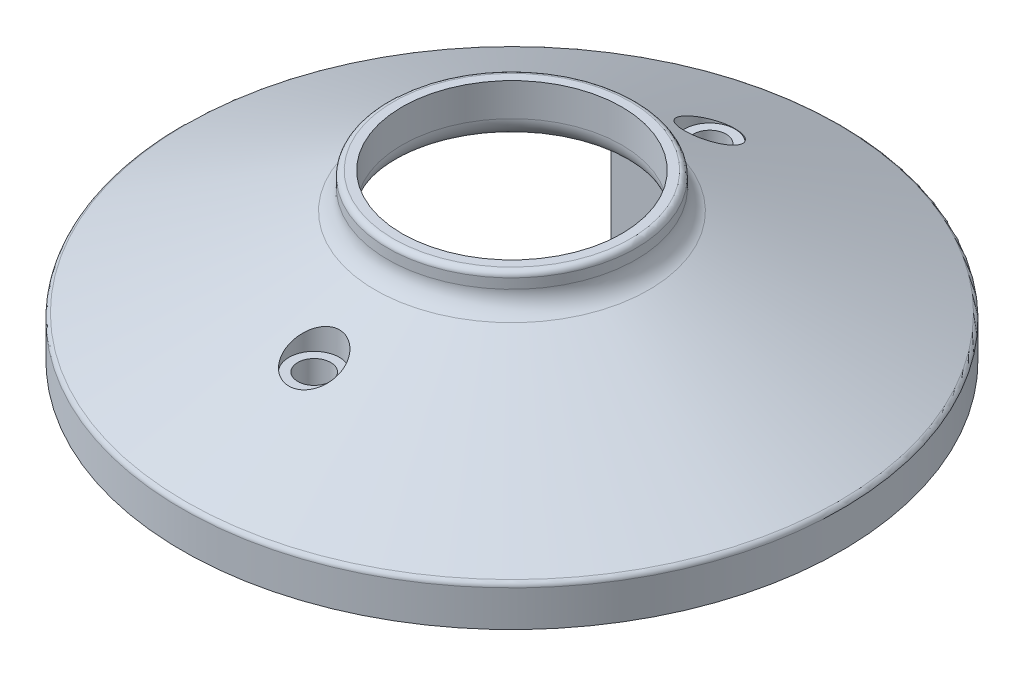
ISO-10303-21;
HEADER;
FILE_DESCRIPTION(('STEP AP214'),'2;1');
FILE_NAME('part.step','',(''),(''),'','','');
FILE_SCHEMA(('AUTOMOTIVE_DESIGN { 1 0 10303 214 1 1 1 1 }'));
ENDSEC;
DATA;
#1=APPLICATION_CONTEXT('core data for automotive mechanical design processes');
#2=APPLICATION_PROTOCOL_DEFINITION('international standard','automotive_design',2000,#1);
#3=PRODUCT_CONTEXT('',#1,'mechanical');
#4=PRODUCT('Part','Part','',(#3));
#5=PRODUCT_RELATED_PRODUCT_CATEGORY('part','',(#4));
#6=PRODUCT_DEFINITION_FORMATION('','',#4);
#7=PRODUCT_DEFINITION_CONTEXT('part definition',#1,'design');
#8=PRODUCT_DEFINITION('design','',#6,#7);
#9=PRODUCT_DEFINITION_SHAPE('','',#8);
#10=(LENGTH_UNIT() NAMED_UNIT(*) SI_UNIT(.MILLI.,.METRE.));
#11=(NAMED_UNIT(*) PLANE_ANGLE_UNIT() SI_UNIT($,.RADIAN.));
#12=(NAMED_UNIT(*) SI_UNIT($,.STERADIAN.) SOLID_ANGLE_UNIT());
#13=UNCERTAINTY_MEASURE_WITH_UNIT(LENGTH_MEASURE(1.E-05),#10,'distance_accuracy_value','');
#14=(GEOMETRIC_REPRESENTATION_CONTEXT(3) GLOBAL_UNCERTAINTY_ASSIGNED_CONTEXT((#13)) GLOBAL_UNIT_ASSIGNED_CONTEXT((#10,
#11,#12)) REPRESENTATION_CONTEXT('',''));
#15=CARTESIAN_POINT('',(0.,0.,0.));
#16=DIRECTION('',(0.,0.,1.));
#17=DIRECTION('',(1.,0.,0.));
#18=AXIS2_PLACEMENT_3D('',#15,#16,#17);
#19=CARTESIAN_POINT('',(0.,4.75117276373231,0.));
#20=DIRECTION('',(0.,-1.,0.));
#21=DIRECTION('',(0.,0.,-1.));
#22=AXIS2_PLACEMENT_3D('',#19,#20,#21);
#23=CONICAL_SURFACE('',#22,37.7333625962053,1.13446401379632);
#24=CARTESIAN_POINT('',(-2.10171793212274,10.6994997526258,-24.888551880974));
#25=CARTESIAN_POINT('',(-2.22245459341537,10.7528924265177,-24.7634475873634));
#26=CARTESIAN_POINT('',(-2.3311553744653,10.8108989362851,-24.628396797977));
#27=CARTESIAN_POINT('',(-2.5221039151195,10.9343210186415,-24.3435009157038));
#28=CARTESIAN_POINT('',(-2.6042898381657,10.9997534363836,-24.1936222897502));
#29=CARTESIAN_POINT('',(-2.74056737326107,11.1359240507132,-23.8846537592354));
#30=CARTESIAN_POINT('',(-2.79476335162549,11.2066413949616,-23.7256005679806));
#31=CARTESIAN_POINT('',(-2.87503942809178,11.3518294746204,-23.4023413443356));
#32=CARTESIAN_POINT('',(-2.90112971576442,11.4262988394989,-23.2381372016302));
#33=CARTESIAN_POINT('',(-2.92599878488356,11.5819462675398,-22.898561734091));
#34=CARTESIAN_POINT('',(-2.92301320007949,11.6632563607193,-22.7231205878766));
#35=CARTESIAN_POINT('',(-2.88586256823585,11.8261702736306,-22.3756497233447));
#36=CARTESIAN_POINT('',(-2.8516848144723,11.9077741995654,-22.2036214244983));
#37=CARTESIAN_POINT('',(-2.75108612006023,12.0718588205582,-21.8617010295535));
#38=CARTESIAN_POINT('',(-2.6835849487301,12.1542712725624,-21.6920913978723));
#39=CARTESIAN_POINT('',(-2.51702600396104,12.3142724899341,-21.3665913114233));
#40=CARTESIAN_POINT('',(-2.41796678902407,12.3918610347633,-21.2107014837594));
#41=CARTESIAN_POINT('',(-2.19323815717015,12.5368902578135,-20.9224072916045));
#42=CARTESIAN_POINT('',(-2.06845679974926,12.6045656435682,-20.7894384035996));
#43=CARTESIAN_POINT('',(-1.86223646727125,12.6978776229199,-20.6077234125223));
#44=CARTESIAN_POINT('',(-1.79029005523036,12.7276247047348,-20.5500892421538));
#45=CARTESIAN_POINT('',(-1.64046559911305,12.783960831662,-20.4413930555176));
#46=CARTESIAN_POINT('',(-1.56259125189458,12.8105518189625,-20.3903269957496));
#47=CARTESIAN_POINT('',(-1.40930409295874,12.857720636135,-20.300072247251));
#48=CARTESIAN_POINT('',(-1.33438842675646,12.8786317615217,-20.2602114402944));
#49=CARTESIAN_POINT('',(-1.18071912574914,12.9171918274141,-20.1869147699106));
#50=CARTESIAN_POINT('',(-1.10196769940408,12.9348426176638,-20.1534752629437));
#51=CARTESIAN_POINT('',(-0.941233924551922,12.9665857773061,-20.0934733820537));
#52=CARTESIAN_POINT('',(-0.859253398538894,12.9806801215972,-20.0669071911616));
#53=CARTESIAN_POINT('',(-0.692768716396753,13.0050633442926,-20.0210246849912));
#54=CARTESIAN_POINT('',(-0.608264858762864,13.0153526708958,-20.0017075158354));
#55=CARTESIAN_POINT('',(-0.371934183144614,13.0382648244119,-19.9587318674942));
#56=CARTESIAN_POINT('',(-0.218124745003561,13.0466370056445,-19.9430838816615));
#57=CARTESIAN_POINT('',(0.0900693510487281,13.0502532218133,-19.9363197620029));
#58=CARTESIAN_POINT('',(0.244453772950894,13.0455021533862,-19.9451944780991));
#59=CARTESIAN_POINT('',(0.540296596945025,13.02385672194,-19.9857463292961));
#60=CARTESIAN_POINT('',(0.6819910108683,13.0076677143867,-20.0160991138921));
#61=CARTESIAN_POINT('',(0.957875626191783,12.9648227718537,-20.0967802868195));
#62=CARTESIAN_POINT('',(1.09206517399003,12.9381659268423,-20.1471104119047));
#63=CARTESIAN_POINT('',(1.35420993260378,12.8746505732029,-20.2677293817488));
#64=CARTESIAN_POINT('',(1.4818074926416,12.8374812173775,-20.3386284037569));
#65=CARTESIAN_POINT('',(1.72327309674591,12.755016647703,-20.4970679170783));
#66=CARTESIAN_POINT('',(1.83713642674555,12.7097186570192,-20.5846140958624));
#67=CARTESIAN_POINT('',(2.05951440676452,12.6080209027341,-20.7827706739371));
#68=CARTESIAN_POINT('',(2.16648032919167,12.5509740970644,-20.8947851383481));
#69=CARTESIAN_POINT('',(2.36028214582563,12.4311635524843,-21.1323317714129));
#70=CARTESIAN_POINT('',(2.44710903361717,12.3683972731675,-21.2578699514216));
#71=CARTESIAN_POINT('',(2.6078822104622,12.2319253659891,-21.5335987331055));
#72=CARTESIAN_POINT('',(2.67940117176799,12.157772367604,-21.6849856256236));
#73=CARTESIAN_POINT('',(2.7954252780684,12.0068755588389,-21.9965739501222));
#74=CARTESIAN_POINT('',(2.83991945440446,11.9301307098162,-22.1567789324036));
#75=CARTESIAN_POINT('',(2.90348612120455,11.7702074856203,-22.4943857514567));
#76=CARTESIAN_POINT('',(2.92039623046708,11.6869791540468,-22.6721750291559));
#77=CARTESIAN_POINT('',(2.92157217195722,11.5220419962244,-23.0286106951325));
#78=CARTESIAN_POINT('',(2.90583160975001,11.4403334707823,-23.2072572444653));
#79=CARTESIAN_POINT('',(2.84105931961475,11.2795524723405,-23.5626065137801));
#80=CARTESIAN_POINT('',(2.79159426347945,11.2005285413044,-23.7392531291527));
#81=CARTESIAN_POINT('',(2.65927430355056,11.0485274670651,-24.0824118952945));
#82=CARTESIAN_POINT('',(2.57642610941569,10.9755491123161,-24.2489260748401));
#83=CARTESIAN_POINT('',(2.38342493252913,10.8412648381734,-24.5579691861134));
#84=CARTESIAN_POINT('',(2.27478282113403,10.7795655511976,-24.7012678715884));
#85=CARTESIAN_POINT('',(2.03067248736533,10.66575630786,-24.9674051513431));
#86=CARTESIAN_POINT('',(1.89521911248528,10.6136410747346,-25.0902550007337));
#87=CARTESIAN_POINT('',(1.61337720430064,10.5247835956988,-25.3008201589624));
#88=CARTESIAN_POINT('',(1.46882156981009,10.4871259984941,-25.3906018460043));
#89=CARTESIAN_POINT('',(1.16432693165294,10.422866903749,-25.5443279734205));
#90=CARTESIAN_POINT('',(1.00439660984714,10.3962592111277,-25.6082868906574));
#91=CARTESIAN_POINT('',(0.68740681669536,10.3567651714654,-25.7033985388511));
#92=CARTESIAN_POINT('',(0.531116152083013,10.3429619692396,-25.7367412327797));
#93=CARTESIAN_POINT('',(0.214640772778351,10.3261101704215,-25.7774636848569));
#94=CARTESIAN_POINT('',(0.0544575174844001,10.323057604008,-25.7848530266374));
#95=CARTESIAN_POINT('',(-0.257702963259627,10.3277049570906,-25.7736145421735));
#96=CARTESIAN_POINT('',(-0.409729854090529,10.3349354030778,-25.7561226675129));
#97=CARTESIAN_POINT('',(-0.708492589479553,10.3590710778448,-25.6978587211));
#98=CARTESIAN_POINT('',(-0.855227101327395,10.375978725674,-25.6570808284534));
#99=CARTESIAN_POINT('',(-1.13988344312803,10.4189913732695,-25.5536839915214));
#100=CARTESIAN_POINT('',(-1.27777322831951,10.4451278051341,-25.4909904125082));
#101=CARTESIAN_POINT('',(-1.54071508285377,10.5057785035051,-25.346146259));
#102=CARTESIAN_POINT('',(-1.66578236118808,10.5402826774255,-25.2640191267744));
#103=CARTESIAN_POINT('',(-1.83996201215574,10.596979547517,-25.1297914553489));
#104=CARTESIAN_POINT('',(-1.89501244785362,10.6163578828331,-25.0840173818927));
#105=CARTESIAN_POINT('',(-2.00128092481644,10.656735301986,-24.9888968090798));
#106=CARTESIAN_POINT('',(-2.05249948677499,10.6777341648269,-24.9395507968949));
#107=CARTESIAN_POINT('',(-2.10171793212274,10.6994997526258,-24.888551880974));
#108=B_SPLINE_CURVE_WITH_KNOTS('',3,(#24,#25,#26,#27,#28,#29,#30,#31,#32,#33,#34,#35,#36,#37,
#38,#39,#40,#41,#42,#43,#44,#45,#46,#47,#48,#49,#50,#51,#52,#53,#54,#55,#56,#57,#58,#59,#60,#61,
#62,#63,#64,#65,#66,#67,#68,#69,#70,#71,#72,#73,#74,#75,#76,#77,#78,#79,#80,#81,#82,#83,#84,#85,
#86,#87,#88,#89,#90,#91,#92,#93,#94,#95,#96,#97,#98,#99,#100,#101,#102,#103,#104,#105,#106,
#107),.UNSPECIFIED.,.T.,.F.,(4,2,2,2,2,2,2,2,2,2,2,2,2,2,2,2,2,2,2,2,2,2,2,2,2,2,2,2,2,2,2,2,2,
2,2,2,2,2,2,2,2,4),(0.,0.545339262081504,1.09194129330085,1.636490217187,2.18084165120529,
2.75842141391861,3.33623656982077,3.93415114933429,4.53209304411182,5.11208565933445,
5.40230704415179,5.69234889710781,5.95418353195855,6.21586915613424,6.47740914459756,
6.73891831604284,7.20075875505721,7.6624268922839,8.09786178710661,8.53333454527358,
8.98334428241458,9.43350804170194,9.92665357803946,10.4200192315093,10.9670337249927,
11.5142700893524,12.1026425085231,12.6911301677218,13.2873254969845,13.8834010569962,
14.4507068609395,15.0176993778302,15.5377649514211,16.057538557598,16.5363086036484,
17.0149018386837,17.4723331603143,17.9298788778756,18.3889982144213,18.8475665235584,
19.0699049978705,19.2922132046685),.UNSPECIFIED.);
#109=CARTESIAN_POINT('',(-2.10171793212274,10.6994997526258,-24.888551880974));
#110=VERTEX_POINT('',#109);
#111=EDGE_CURVE('E361',#110,#110,#108,.T.);
#112=ORIENTED_EDGE('',*,*,#111,.F.);
#113=EDGE_LOOP('',(#112));
#114=FACE_BOUND('',#113,.T.);
#115=CARTESIAN_POINT('',(0.,14.9706841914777,0.));
#116=DIRECTION('',(0.,-1.,0.));
#117=DIRECTION('',(0.,0.,-1.));
#118=AXIS2_PLACEMENT_3D('',#115,#116,#117);
#119=CIRCLE('',#118,15.8175496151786);
#120=CARTESIAN_POINT('',(0.,14.9706841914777,-15.8175496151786));
#121=VERTEX_POINT('',#120);
#122=EDGE_CURVE('E506',#121,#121,#119,.T.);
#123=ORIENTED_EDGE('',*,*,#122,.T.);
#124=EDGE_LOOP('',(#123));
#125=FACE_BOUND('',#124,.T.);
#126=CARTESIAN_POINT('',(0.,4.75117276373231,0.));
#127=DIRECTION('',(0.,-1.,0.));
#128=DIRECTION('',(0.,0.,-1.));
#129=AXIS2_PLACEMENT_3D('',#126,#127,#128);
#130=CIRCLE('',#129,37.7333625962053);
#131=CARTESIAN_POINT('',(0.,4.75117276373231,-37.7333625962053));
#132=VERTEX_POINT('',#131);
#133=EDGE_CURVE('E509',#132,#132,#130,.T.);
#134=ORIENTED_EDGE('',*,*,#133,.F.);
#135=EDGE_LOOP('',(#134));
#136=FACE_BOUND('',#135,.T.);
#137=CARTESIAN_POINT('',(-2.1877705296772,12.5360552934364,20.924565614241));
#138=CARTESIAN_POINT('',(-2.08483135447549,12.5950109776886,20.8082081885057));
#139=CARTESIAN_POINT('',(-1.97176940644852,12.6508130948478,20.6991340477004));
#140=CARTESIAN_POINT('',(-1.72714990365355,12.7539473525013,20.4990344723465));
#141=CARTESIAN_POINT('',(-1.59558781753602,12.8012774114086,20.4080134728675));
#142=CARTESIAN_POINT('',(-1.31602350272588,12.8853606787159,20.2472571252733));
#143=CARTESIAN_POINT('',(-1.1679494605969,12.9220649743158,20.1776201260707));
#144=CARTESIAN_POINT('',(-0.859878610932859,12.9823869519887,20.063613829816));
#145=CARTESIAN_POINT('',(-0.699889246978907,13.0060127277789,20.0192289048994));
#146=CARTESIAN_POINT('',(-0.385942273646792,13.0372922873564,19.9605535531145));
#147=CARTESIAN_POINT('',(-0.232479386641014,13.0460428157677,19.9441958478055));
#148=CARTESIAN_POINT('',(0.0752711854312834,13.0504667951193,19.935919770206));
#149=CARTESIAN_POINT('',(0.229558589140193,13.0461444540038,19.9439935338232));
#150=CARTESIAN_POINT('',(0.525531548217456,13.025319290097,19.9830043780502));
#151=CARTESIAN_POINT('',(0.667440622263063,13.009507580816,20.0126443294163));
#152=CARTESIAN_POINT('',(0.943874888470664,12.9673758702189,20.0919637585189));
#153=CARTESIAN_POINT('',(1.07839947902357,12.9410550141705,20.1416448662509));
#154=CARTESIAN_POINT('',(1.34113462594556,12.8782123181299,20.2609460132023));
#155=CARTESIAN_POINT('',(1.46900534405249,12.8413909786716,20.3311532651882));
#156=CARTESIAN_POINT('',(1.71112209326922,12.7595839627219,20.4882596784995));
#157=CARTESIAN_POINT('',(1.82536350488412,12.714595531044,20.5751644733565));
#158=CARTESIAN_POINT('',(2.04855442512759,12.6135344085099,20.7719755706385));
#159=CARTESIAN_POINT('',(2.15597528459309,12.5568152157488,20.8832814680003));
#160=CARTESIAN_POINT('',(2.35080230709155,12.437614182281,21.1194722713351));
#161=CARTESIAN_POINT('',(2.43819951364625,12.3751297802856,21.2443632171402));
#162=CARTESIAN_POINT('',(2.60030312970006,12.2391893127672,21.5188271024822));
#163=CARTESIAN_POINT('',(2.67258992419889,12.1652795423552,21.6696067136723));
#164=CARTESIAN_POINT('',(2.79026523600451,12.0148072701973,21.9800847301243));
#165=CARTESIAN_POINT('',(2.83564278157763,11.9382436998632,22.1397867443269));
#166=CARTESIAN_POINT('',(2.90118579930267,11.7785610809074,22.4766202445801));
#167=CARTESIAN_POINT('',(2.91917114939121,11.6953863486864,22.6541535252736));
#168=CARTESIAN_POINT('',(2.92256424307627,11.5304795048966,23.0102442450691));
#169=CARTESIAN_POINT('',(2.90796544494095,11.4487476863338,23.188801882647));
#170=CARTESIAN_POINT('',(2.84550831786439,11.2877469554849,23.5443663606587));
#171=CARTESIAN_POINT('',(2.79717932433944,11.2085296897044,23.7213149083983));
#172=CARTESIAN_POINT('',(2.66708373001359,11.0560681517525,24.0652748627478));
#173=CARTESIAN_POINT('',(2.58532355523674,10.9828227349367,24.2322881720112));
#174=CARTESIAN_POINT('',(2.39427655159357,10.8478848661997,24.5426462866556));
#175=CARTESIAN_POINT('',(2.28647755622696,10.7858094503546,24.6867376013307));
#176=CARTESIAN_POINT('',(2.04388649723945,10.6712036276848,24.954602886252));
#177=CARTESIAN_POINT('',(1.90910932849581,10.6186679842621,25.0783879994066));
#178=CARTESIAN_POINT('',(1.6283257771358,10.5289601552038,25.2908853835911));
#179=CARTESIAN_POINT('',(1.48416274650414,10.4908781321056,25.38164848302));
#180=CARTESIAN_POINT('',(1.18024593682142,10.4257628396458,25.5373793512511));
#181=CARTESIAN_POINT('',(1.02050106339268,10.3987233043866,25.6023617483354));
#182=CARTESIAN_POINT('',(0.703722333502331,10.3584173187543,25.6994122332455));
#183=CARTESIAN_POINT('',(0.547477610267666,10.3442288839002,25.7336813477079));
#184=CARTESIAN_POINT('',(0.230907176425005,10.3266197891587,25.7762306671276));
#185=CARTESIAN_POINT('',(0.0705827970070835,10.3231956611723,25.7845192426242));
#186=CARTESIAN_POINT('',(-0.241914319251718,10.3271435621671,25.7749721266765));
#187=CARTESIAN_POINT('',(-0.394130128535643,10.3340382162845,25.7582915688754));
#188=CARTESIAN_POINT('',(-0.693359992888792,10.3575210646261,25.7015977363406));
#189=CARTESIAN_POINT('',(-0.840374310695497,10.374108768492,25.6615856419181));
#190=CARTESIAN_POINT('',(-1.12553530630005,10.4164843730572,25.5597017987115));
#191=CARTESIAN_POINT('',(-1.26366268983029,10.4422915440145,25.4977842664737));
#192=CARTESIAN_POINT('',(-1.52734141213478,10.5023170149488,25.3543946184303));
#193=CARTESIAN_POINT('',(-1.65289077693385,10.5365366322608,25.2729194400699));
#194=CARTESIAN_POINT('',(-1.89400256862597,10.61414515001,25.0891227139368));
#195=CARTESIAN_POINT('',(-2.00886747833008,10.6578756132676,24.9860319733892));
#196=CARTESIAN_POINT('',(-2.21971201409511,10.7523138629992,24.7648586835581));
#197=CARTESIAN_POINT('',(-2.31568612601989,10.8030236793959,24.6467717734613));
#198=CARTESIAN_POINT('',(-2.49350451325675,10.9141217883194,24.3899689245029));
#199=CARTESIAN_POINT('',(-2.57381005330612,10.9749460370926,24.2503768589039));
#200=CARTESIAN_POINT('',(-2.709888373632,11.1017472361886,23.961910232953));
#201=CARTESIAN_POINT('',(-2.7656534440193,11.1677257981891,23.8130327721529));
#202=CARTESIAN_POINT('',(-2.85562338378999,11.3088066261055,23.4976802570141));
#203=CARTESIAN_POINT('',(-2.88775074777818,11.384216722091,23.330749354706));
#204=CARTESIAN_POINT('',(-2.92276617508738,11.5375588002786,22.9949379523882));
#205=CARTESIAN_POINT('',(-2.92563829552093,11.6154921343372,22.8260564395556));
#206=CARTESIAN_POINT('',(-2.9017137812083,11.7767915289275,22.4803781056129));
#207=CARTESIAN_POINT('',(-2.87310122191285,11.8601996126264,22.3037249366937));
#208=CARTESIAN_POINT('',(-2.7839550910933,12.0254012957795,21.957961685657));
#209=CARTESIAN_POINT('',(-2.72344343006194,12.1071959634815,21.788846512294));
#210=CARTESIAN_POINT('',(-2.58885885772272,12.2484718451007,21.5000907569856));
#211=CARTESIAN_POINT('',(-2.52099190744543,12.3087999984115,21.3779400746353));
#212=CARTESIAN_POINT('',(-2.36748945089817,12.4256480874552,21.1433548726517));
#213=CARTESIAN_POINT('',(-2.28185838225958,12.4821689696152,21.0309179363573));
#214=CARTESIAN_POINT('',(-2.1877705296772,12.5360552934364,20.924565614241));
#215=B_SPLINE_CURVE_WITH_KNOTS('',3,(#137,#138,#139,#140,#141,#142,#143,#144,#145,#146,#147,
#148,#149,#150,#151,#152,#153,#154,#155,#156,#157,#158,#159,#160,#161,#162,#163,#164,#165,#166,
#167,#168,#169,#170,#171,#172,#173,#174,#175,#176,#177,#178,#179,#180,#181,#182,#183,#184,#185,
#186,#187,#188,#189,#190,#191,#192,#193,#194,#195,#196,#197,#198,#199,#200,#201,#202,#203,#204,
#205,#206,#207,#208,#209,#210,#211,#212,#213,#214),.UNSPECIFIED.,.T.,.F.,(4,2,2,2,2,2,2,2,2,2,2,
2,2,2,2,2,2,2,2,2,2,2,2,2,2,2,2,2,2,2,2,2,2,2,2,2,2,2,4),(0.,0.498032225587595,
0.996186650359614,1.49659900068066,1.99670132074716,2.45801249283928,2.91917519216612,
3.35467842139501,3.79021707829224,4.23969402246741,4.68932288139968,5.18158130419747,
5.67405948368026,6.22018600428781,6.76653504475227,7.35443900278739,7.94246100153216,
8.53885659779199,9.13513761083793,9.70316547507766,10.2708805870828,10.7917657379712,
11.3123549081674,11.7916714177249,12.2708334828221,12.7285026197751,13.1861486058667,
13.6447568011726,14.103436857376,14.5826251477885,15.0619531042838,15.5762006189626,
16.0906095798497,16.646100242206,17.2018936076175,17.7915060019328,18.3807139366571,
18.8360359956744,19.2912444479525),.UNSPECIFIED.);
#216=CARTESIAN_POINT('',(-2.1877705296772,12.5360552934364,20.924565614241));
#217=VERTEX_POINT('',#216);
#218=EDGE_CURVE('E37',#217,#217,#215,.T.);
#219=ORIENTED_EDGE('',*,*,#218,.T.);
#220=EDGE_LOOP('',(#219));
#221=FACE_BOUND('',#220,.T.);
#222=ADVANCED_FACE('F33',(#114,#125,#136,#221),#23,.T.);
#223=CARTESIAN_POINT('',(0.,19.05,22.86));
#224=DIRECTION('',(0.,-1.,0.));
#225=DIRECTION('',(0.,0.,-1.));
#226=AXIS2_PLACEMENT_3D('',#223,#224,#225);
#227=CYLINDRICAL_SURFACE('',#226,1.905);
#228=CARTESIAN_POINT('',(0.,0.,22.86));
#229=DIRECTION('',(0.,1.,0.));
#230=DIRECTION('',(0.,0.,1.));
#231=AXIS2_PLACEMENT_3D('',#228,#229,#230);
#232=CIRCLE('',#231,1.905);
#233=CARTESIAN_POINT('',(0.,0.,24.765));
#234=VERTEX_POINT('',#233);
#235=EDGE_CURVE('E237',#234,#234,#232,.T.);
#236=ORIENTED_EDGE('',*,*,#235,.F.);
#237=EDGE_LOOP('',(#236));
#238=FACE_BOUND('',#237,.T.);
#239=CARTESIAN_POINT('',(0.,10.287,22.86));
#240=DIRECTION('',(0.,1.,0.));
#241=DIRECTION('',(0.,0.,1.));
#242=AXIS2_PLACEMENT_3D('',#239,#240,#241);
#243=CIRCLE('',#242,1.905);
#244=CARTESIAN_POINT('',(0.,10.287,24.765));
#245=VERTEX_POINT('',#244);
#246=EDGE_CURVE('E277',#245,#245,#243,.T.);
#247=ORIENTED_EDGE('',*,*,#246,.T.);
#248=EDGE_LOOP('',(#247));
#249=FACE_BOUND('',#248,.T.);
#250=ADVANCED_FACE('F344',(#238,#249),#227,.F.);
#251=CARTESIAN_POINT('',(0.,0.,0.));
#252=DIRECTION('',(0.,1.,0.));
#253=DIRECTION('',(0.,0.,-1.));
#254=AXIS2_PLACEMENT_3D('',#251,#252,#253);
#255=PLANE('',#254);
#256=DIRECTION('',(-1.,0.,0.));
#257=VECTOR('',#256,1.);
#258=CARTESIAN_POINT('',(-6.35,0.,17.78));
#259=LINE('',#258,#257);
#260=CARTESIAN_POINT('',(2.54,0.,17.78));
#261=VERTEX_POINT('',#260);
#262=CARTESIAN_POINT('',(-2.54,0.,17.78));
#263=VERTEX_POINT('',#262);
#264=EDGE_CURVE('E273',#261,#263,#259,.T.);
#265=ORIENTED_EDGE('',*,*,#264,.F.);
#266=DIRECTION('',(0.,0.,1.));
#267=VECTOR('',#266,1.);
#268=CARTESIAN_POINT('',(2.54,0.,19.0584760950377));
#269=LINE('',#268,#267);
#270=CARTESIAN_POINT('',(2.54,0.,19.0584760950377));
#271=VERTEX_POINT('',#270);
#272=EDGE_CURVE('E236',#261,#271,#269,.T.);
#273=ORIENTED_EDGE('',*,*,#272,.T.);
#274=CARTESIAN_POINT('',(0.,0.,22.86));
#275=DIRECTION('',(0.,-1.,0.));
#276=DIRECTION('',(0.,0.,-1.));
#277=AXIS2_PLACEMENT_3D('',#274,#275,#276);
#278=CIRCLE('',#277,4.572);
#279=CARTESIAN_POINT('',(4.572,0.,22.86));
#280=VERTEX_POINT('',#279);
#281=EDGE_CURVE('E206',#271,#280,#278,.T.);
#282=ORIENTED_EDGE('',*,*,#281,.T.);
#283=DIRECTION('',(1.,0.,0.));
#284=VECTOR('',#283,1.);
#285=CARTESIAN_POINT('',(6.35,0.,22.86));
#286=LINE('',#285,#284);
#287=CARTESIAN_POINT('',(6.35,0.,22.86));
#288=VERTEX_POINT('',#287);
#289=EDGE_CURVE('E222',#280,#288,#286,.T.);
#290=ORIENTED_EDGE('',*,*,#289,.T.);
#291=DIRECTION('',(0.,0.,-1.));
#292=VECTOR('',#291,1.);
#293=CARTESIAN_POINT('',(6.35,0.,27.94));
#294=LINE('',#293,#292);
#295=CARTESIAN_POINT('',(6.35,0.,27.94));
#296=VERTEX_POINT('',#295);
#297=EDGE_CURVE('E699',#296,#288,#294,.T.);
#298=ORIENTED_EDGE('',*,*,#297,.F.);
#299=DIRECTION('',(1.,0.,0.));
#300=VECTOR('',#299,1.);
#301=CARTESIAN_POINT('',(-6.35,0.,27.94));
#302=LINE('',#301,#300);
#303=CARTESIAN_POINT('',(-6.35,0.,27.94));
#304=VERTEX_POINT('',#303);
#305=EDGE_CURVE('E695',#304,#296,#302,.T.);
#306=ORIENTED_EDGE('',*,*,#305,.F.);
#307=DIRECTION('',(0.,0.,1.));
#308=VECTOR('',#307,1.);
#309=CARTESIAN_POINT('',(-6.35,0.,27.94));
#310=LINE('',#309,#308);
#311=CARTESIAN_POINT('',(-6.35,0.,22.86));
#312=VERTEX_POINT('',#311);
#313=EDGE_CURVE('E276',#312,#304,#310,.T.);
#314=ORIENTED_EDGE('',*,*,#313,.F.);
#315=DIRECTION('',(1.,0.,0.));
#316=VECTOR('',#315,1.);
#317=CARTESIAN_POINT('',(-6.35,0.,22.86));
#318=LINE('',#317,#316);
#319=CARTESIAN_POINT('',(-4.572,0.,22.86));
#320=VERTEX_POINT('',#319);
#321=EDGE_CURVE('E263',#312,#320,#318,.T.);
#322=ORIENTED_EDGE('',*,*,#321,.T.);
#323=CARTESIAN_POINT('',(0.,0.,22.86));
#324=DIRECTION('',(0.,-1.,0.));
#325=DIRECTION('',(0.,0.,1.));
#326=AXIS2_PLACEMENT_3D('',#323,#324,#325);
#327=CIRCLE('',#326,4.572);
#328=CARTESIAN_POINT('',(-2.54,0.,19.0584760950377));
#329=VERTEX_POINT('',#328);
#330=EDGE_CURVE('E54',#320,#329,#327,.T.);
#331=ORIENTED_EDGE('',*,*,#330,.T.);
#332=DIRECTION('',(0.,0.,-1.));
#333=VECTOR('',#332,1.);
#334=CARTESIAN_POINT('',(-2.54,0.,19.0584760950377));
#335=LINE('',#334,#333);
#336=EDGE_CURVE('E249',#329,#263,#335,.T.);
#337=ORIENTED_EDGE('',*,*,#336,.T.);
#338=EDGE_LOOP('',(#265,#273,#282,#290,#298,#306,#314,#322,#331,#337));
#339=FACE_BOUND('',#338,.T.);
#340=ORIENTED_EDGE('',*,*,#235,.T.);
#341=EDGE_LOOP('',(#340));
#342=FACE_BOUND('',#341,.T.);
#343=ADVANCED_FACE('F311',(#339,#342),#255,.F.);
#344=CARTESIAN_POINT('',(0.,12.9379782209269,0.));
#345=DIRECTION('',(0.,-1.,0.));
#346=DIRECTION('',(0.,0.,-1.));
#347=AXIS2_PLACEMENT_3D('',#344,#345,#346);
#348=CONICAL_SURFACE('',#347,14.1665496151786,1.13446401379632);
#349=CARTESIAN_POINT('',(0.,12.9379782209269,0.));
#350=DIRECTION('',(0.,-1.,0.));
#351=DIRECTION('',(0.,0.,-1.));
#352=AXIS2_PLACEMENT_3D('',#349,#350,#351);
#353=CIRCLE('',#352,14.1665496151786);
#354=CARTESIAN_POINT('',(0.,12.9379782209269,-14.1665496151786));
#355=VERTEX_POINT('',#354);
#356=EDGE_CURVE('E665',#355,#355,#353,.T.);
#357=ORIENTED_EDGE('',*,*,#356,.F.);
#358=EDGE_LOOP('',(#357));
#359=FACE_BOUND('',#358,.T.);
#360=CARTESIAN_POINT('',(0.,3.13301430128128,0.));
#361=DIRECTION('',(0.,-1.,0.));
#362=DIRECTION('',(0.,0.,-1.));
#363=AXIS2_PLACEMENT_3D('',#360,#361,#362);
#364=CIRCLE('',#363,35.1933625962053);
#365=CARTESIAN_POINT('',(0.,3.13301430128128,-35.1933625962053));
#366=VERTEX_POINT('',#365);
#367=EDGE_CURVE('E660',#366,#366,#364,.T.);
#368=ORIENTED_EDGE('',*,*,#367,.T.);
#369=EDGE_LOOP('',(#368));
#370=FACE_BOUND('',#369,.T.);
#371=CARTESIAN_POINT('',(6.35,16.2985515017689,-2.84885859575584));
#372=CARTESIAN_POINT('',(6.35,16.2697023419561,-2.99999552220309));
#373=CARTESIAN_POINT('',(6.35,16.2390134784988,-3.15077008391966));
#374=CARTESIAN_POINT('',(6.35,16.1743105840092,-3.45158736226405));
#375=CARTESIAN_POINT('',(6.35,16.1402969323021,-3.60163016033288));
#376=CARTESIAN_POINT('',(6.35,16.0338312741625,-4.05052557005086));
#377=CARTESIAN_POINT('',(6.35,15.9569197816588,-4.34832306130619));
#378=CARTESIAN_POINT('',(6.35,15.7938230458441,-4.94075557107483));
#379=CARTESIAN_POINT('',(6.35,15.7076547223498,-5.23539531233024));
#380=CARTESIAN_POINT('',(6.35,15.5278961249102,-5.82244328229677));
#381=CARTESIAN_POINT('',(6.35,15.4343046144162,-6.11485113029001));
#382=CARTESIAN_POINT('',(6.35,15.2415101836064,-6.69699079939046));
#383=CARTESIAN_POINT('',(6.35,15.1423218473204,-6.98672747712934));
#384=CARTESIAN_POINT('',(6.35,14.9393120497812,-7.56457473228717));
#385=CARTESIAN_POINT('',(6.35,14.8354904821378,-7.85268527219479));
#386=CARTESIAN_POINT('',(6.35,14.6240770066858,-8.42769409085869));
#387=CARTESIAN_POINT('',(6.35,14.5164830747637,-8.71459162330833));
#388=CARTESIAN_POINT('',(6.35,14.2982852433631,-9.28724185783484));
#389=CARTESIAN_POINT('',(6.35,14.1876813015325,-9.57299454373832));
#390=CARTESIAN_POINT('',(6.35,13.9367602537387,-10.213068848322));
#391=CARTESIAN_POINT('',(6.35,13.7957717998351,-10.5671269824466));
#392=CARTESIAN_POINT('',(6.35,13.5108047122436,-11.2740387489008));
#393=CARTESIAN_POINT('',(6.35,13.3668260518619,-11.6268923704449));
#394=CARTESIAN_POINT('',(6.35,13.0764748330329,-12.3316241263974));
#395=CARTESIAN_POINT('',(6.35,12.9301022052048,-12.6835022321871));
#396=CARTESIAN_POINT('',(6.35,12.6354182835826,-13.3864462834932));
#397=CARTESIAN_POINT('',(6.35,12.4871069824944,-13.7375122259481));
#398=CARTESIAN_POINT('',(6.35,12.0398523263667,-14.7896037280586));
#399=CARTESIAN_POINT('',(6.35,11.7385460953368,-15.4896245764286));
#400=CARTESIAN_POINT('',(6.35,11.1315953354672,-16.887761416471));
#401=CARTESIAN_POINT('',(6.35,10.8259508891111,-17.58587744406));
#402=CARTESIAN_POINT('',(6.35,10.2106900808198,-18.982619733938));
#403=CARTESIAN_POINT('',(6.35,9.90106518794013,-19.6812422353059));
#404=CARTESIAN_POINT('',(6.35,9.27947695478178,-21.0774487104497));
#405=CARTESIAN_POINT('',(6.35,8.9675136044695,-21.7750326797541));
#406=CARTESIAN_POINT('',(6.35,8.34180968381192,-23.1693991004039));
#407=CARTESIAN_POINT('',(6.35,8.02806912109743,-23.8661815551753));
#408=CARTESIAN_POINT('',(6.35,7.39920407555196,-25.2591217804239));
#409=CARTESIAN_POINT('',(6.35,7.08407959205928,-25.9552795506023));
#410=CARTESIAN_POINT('',(6.35,6.3265846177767,-27.6252112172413));
#411=CARTESIAN_POINT('',(6.35,5.88369041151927,-28.5987475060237));
#412=CARTESIAN_POINT('',(6.35,4.99631548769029,-30.5450971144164));
#413=CARTESIAN_POINT('',(6.35,4.55183476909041,-31.5179104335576));
#414=CARTESIAN_POINT('',(6.35,3.21660161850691,-34.4355326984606));
#415=CARTESIAN_POINT('',(6.35,2.32405897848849,-36.3795222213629));
#416=CARTESIAN_POINT('',(6.35,0.539912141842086,-40.2577713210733));
#417=CARTESIAN_POINT('',(6.35,-0.351679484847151,-42.1920366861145));
#418=CARTESIAN_POINT('',(6.35,-1.69051895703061,-45.0927579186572));
#419=CARTESIAN_POINT('',(6.35,-2.13703955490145,-46.0595495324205));
#420=CARTESIAN_POINT('',(6.35,-3.03048866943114,-47.9929440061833));
#421=CARTESIAN_POINT('',(6.35,-3.4774171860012,-48.9595468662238));
#422=CARTESIAN_POINT('',(6.35,-3.92451130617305,-49.9260730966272));
#423=B_SPLINE_CURVE_WITH_KNOTS('',3,(#371,#372,#373,#374,#375,#376,#377,#378,#379,#380,#381,
#382,#383,#384,#385,#386,#387,#388,#389,#390,#391,#392,#393,#394,#395,#396,#397,#398,#399,#400,
#401,#402,#403,#404,#405,#406,#407,#408,#409,#410,#411,#412,#413,#414,#415,#416,#417,#418,#419,
#420,#421,#422),.UNSPECIFIED.,.F.,.F.,(4,2,2,2,2,2,2,2,2,2,2,2,2,2,2,2,2,2,2,2,2,2,2,2,2,4),(0.,
0.461568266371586,0.923083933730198,1.84557200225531,2.76640172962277,3.68738517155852,
4.60607061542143,5.52477716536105,6.44398443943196,7.36320465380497,8.50647743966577,
9.64976043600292,10.7930766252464,11.9363971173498,14.2227081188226,16.5089757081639,
18.801450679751,21.0939354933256,23.3864104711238,25.6788865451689,28.8875218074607,
32.0961591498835,38.5134395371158,44.9030285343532,48.0978054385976,51.2925816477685),.UNSPECIFIED.);
#424=CARTESIAN_POINT('',(6.35,10.7401034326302,-17.78));
#425=VERTEX_POINT('',#424);
#426=CARTESIAN_POINT('',(6.35,6.18306582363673,-27.94));
#427=VERTEX_POINT('',#426);
#428=EDGE_CURVE('E444',#425,#427,#423,.T.);
#429=ORIENTED_EDGE('',*,*,#428,.T.);
#430=CARTESIAN_POINT('',(16.3616510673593,4.4457505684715,-27.94));
#431=CARTESIAN_POINT('',(15.4870381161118,4.65182766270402,-27.94));
#432=CARTESIAN_POINT('',(14.609570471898,4.84630811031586,-27.94));
#433=CARTESIAN_POINT('',(12.8487836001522,5.20842084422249,-27.94));
#434=CARTESIAN_POINT('',(11.9654622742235,5.37604289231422,-27.94));
#435=CARTESIAN_POINT('',(10.1920251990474,5.68087356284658,-27.94));
#436=CARTESIAN_POINT('',(9.30190062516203,5.81803139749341,-27.94));
#437=CARTESIAN_POINT('',(7.51708939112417,6.05789627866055,-27.94));
#438=CARTESIAN_POINT('',(6.62240328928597,6.160607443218,-27.94));
#439=CARTESIAN_POINT('',(4.84925816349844,6.32660218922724,-27.94));
#440=CARTESIAN_POINT('',(3.97087657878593,6.39070558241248,-27.94));
#441=CARTESIAN_POINT('',(2.2121300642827,6.48089617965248,-27.94));
#442=CARTESIAN_POINT('',(1.33176511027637,6.50698291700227,-27.94));
#443=CARTESIAN_POINT('',(-0.428165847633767,6.52023623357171,-27.94));
#444=CARTESIAN_POINT('',(-1.30773149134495,6.50745095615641,-27.94));
#445=CARTESIAN_POINT('',(-3.06548872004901,6.44349909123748,-27.94));
#446=CARTESIAN_POINT('',(-3.94368027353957,6.3923316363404,-27.94));
#447=CARTESIAN_POINT('',(-5.3850278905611,6.27807366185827,-27.94));
#448=CARTESIAN_POINT('',(-5.94906229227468,6.22570874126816,-27.94));
#449=CARTESIAN_POINT('',(-7.07560012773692,6.1064638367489,-27.94));
#450=CARTESIAN_POINT('',(-7.63810353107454,6.03958356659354,-27.94));
#451=CARTESIAN_POINT('',(-9.32297221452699,5.81833108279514,-27.94));
#452=CARTESIAN_POINT('',(-10.442671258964,5.64334921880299,-27.94));
#453=CARTESIAN_POINT('',(-12.6761296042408,5.24525697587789,-27.94));
#454=CARTESIAN_POINT('',(-13.789867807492,5.02203046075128,-27.94));
#455=CARTESIAN_POINT('',(-16.008392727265,4.53525908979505,-27.94));
#456=CARTESIAN_POINT('',(-17.1131796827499,4.27171531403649,-27.94));
#457=CARTESIAN_POINT('',(-19.3487568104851,3.70243020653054,-27.94));
#458=CARTESIAN_POINT('',(-20.4792733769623,3.39562322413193,-27.94));
#459=CARTESIAN_POINT('',(-22.7320708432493,2.75301080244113,-27.94));
#460=CARTESIAN_POINT('',(-23.8543511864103,2.41720342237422,-27.94));
#461=CARTESIAN_POINT('',(-25.5290144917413,1.89678952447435,-27.94));
#462=CARTESIAN_POINT('',(-26.0841836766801,1.72106627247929,-27.94));
#463=CARTESIAN_POINT('',(-27.1928265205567,1.36433400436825,-27.94));
#464=CARTESIAN_POINT('',(-27.7463001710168,1.18332496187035,-27.94));
#465=CARTESIAN_POINT('',(-28.8515154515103,0.81658517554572,-27.94));
#466=CARTESIAN_POINT('',(-29.4032575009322,0.630855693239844,-27.94));
#467=CARTESIAN_POINT('',(-30.5052559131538,0.255075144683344,-27.94));
#468=CARTESIAN_POINT('',(-31.0555123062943,0.0650241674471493,-27.94));
#469=CARTESIAN_POINT('',(-31.6050868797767,-0.126968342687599,-27.94));
#470=B_SPLINE_CURVE_WITH_KNOTS('',3,(#430,#431,#432,#433,#434,#435,#436,#437,#438,#439,#440,
#441,#442,#443,#444,#445,#446,#447,#448,#449,#450,#451,#452,#453,#454,#455,#456,#457,#458,#459,
#460,#461,#462,#463,#464,#465,#466,#467,#468,#469),.UNSPECIFIED.,.F.,.F.,(4,2,2,2,2,2,2,2,2,2,2,
2,2,2,2,2,2,2,2,4),(0.,2.69578802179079,5.39260122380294,8.09387716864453,10.7948300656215,
13.4361981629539,16.0775986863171,18.7157291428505,21.3539192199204,23.0531193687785,
24.7523530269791,28.1508946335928,31.5577103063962,34.9644347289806,38.4781955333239,
41.9921916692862,43.7391184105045,45.4860538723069,47.2325272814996,48.9789647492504),.UNSPECIFIED.);
#471=CARTESIAN_POINT('',(-6.35,6.18306582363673,-27.94));
#472=VERTEX_POINT('',#471);
#473=EDGE_CURVE('E440',#427,#472,#470,.T.);
#474=ORIENTED_EDGE('',*,*,#473,.T.);
#475=CARTESIAN_POINT('',(-6.35,-3.92451130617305,-49.9260730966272));
#476=CARTESIAN_POINT('',(-6.35,-3.47625694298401,-48.957041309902));
#477=CARTESIAN_POINT('',(-6.35,-3.02817058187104,-47.9879318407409));
#478=CARTESIAN_POINT('',(-6.35,-2.13240887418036,-46.0495247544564));
#479=CARTESIAN_POINT('',(-6.35,-1.68473352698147,-45.08022713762));
#480=CARTESIAN_POINT('',(-6.35,-0.342621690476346,-42.1724040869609));
#481=CARTESIAN_POINT('',(-6.35,0.551088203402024,-40.2335430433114));
#482=CARTESIAN_POINT('',(-6.35,1.88916063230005,-37.3248392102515));
#483=CARTESIAN_POINT('',(-6.35,2.33463042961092,-36.3555058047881));
#484=CARTESIAN_POINT('',(-6.35,3.22462948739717,-34.4164129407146));
#485=CARTESIAN_POINT('',(-6.35,3.66915875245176,-33.4466534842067));
#486=CARTESIAN_POINT('',(-6.35,4.55710381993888,-31.5063922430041));
#487=CARTESIAN_POINT('',(-6.35,5.00051938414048,-30.5358903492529));
#488=CARTESIAN_POINT('',(-6.35,5.88578028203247,-28.5941495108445));
#489=CARTESIAN_POINT('',(-6.35,6.32762558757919,-27.6229105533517));
#490=CARTESIAN_POINT('',(-6.35,7.20976357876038,-25.6782093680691));
#491=CARTESIAN_POINT('',(-6.35,7.65005351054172,-24.7047458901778));
#492=CARTESIAN_POINT('',(-6.35,8.52764009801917,-22.7565446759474));
#493=CARTESIAN_POINT('',(-6.35,8.96493694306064,-21.7818070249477));
#494=CARTESIAN_POINT('',(-6.35,9.83500769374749,-19.8310045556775));
#495=CARTESIAN_POINT('',(-6.35,10.2677841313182,-18.8549408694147));
#496=CARTESIAN_POINT('',(-6.35,10.9121065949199,-17.3885798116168));
#497=CARTESIAN_POINT('',(-6.35,11.1260985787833,-16.8993575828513));
#498=CARTESIAN_POINT('',(-6.35,11.5520035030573,-15.9200094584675));
#499=CARTESIAN_POINT('',(-6.35,11.7639164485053,-15.4298835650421));
#500=CARTESIAN_POINT('',(-6.35,12.185514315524,-14.4474791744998));
#501=CARTESIAN_POINT('',(-6.35,12.3951937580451,-13.9551983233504));
#502=CARTESIAN_POINT('',(-6.35,12.8110453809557,-12.9691767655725));
#503=CARTESIAN_POINT('',(-6.35,13.0172176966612,-12.4754361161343));
#504=CARTESIAN_POINT('',(-6.35,13.4247289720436,-11.4863672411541));
#505=CARTESIAN_POINT('',(-6.35,13.6260712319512,-10.991040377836));
#506=CARTESIAN_POINT('',(-6.35,14.0223696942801,-9.99773588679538));
#507=CARTESIAN_POINT('',(-6.35,14.2173249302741,-9.49975787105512));
#508=CARTESIAN_POINT('',(-6.35,14.5031722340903,-8.74950554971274));
#509=CARTESIAN_POINT('',(-6.35,14.5974798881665,-8.49853294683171));
#510=CARTESIAN_POINT('',(-6.35,14.7833169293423,-7.99556267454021));
#511=CARTESIAN_POINT('',(-6.35,14.8748463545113,-7.74356501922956));
#512=CARTESIAN_POINT('',(-6.35,15.054510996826,-7.2384681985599));
#513=CARTESIAN_POINT('',(-6.35,15.1426475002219,-6.98536949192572));
#514=CARTESIAN_POINT('',(-6.35,15.3148218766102,-6.47778565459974));
#515=CARTESIAN_POINT('',(-6.35,15.3988598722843,-6.22330056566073));
#516=CARTESIAN_POINT('',(-6.35,15.5621245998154,-5.71206295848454));
#517=CARTESIAN_POINT('',(-6.35,15.6413384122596,-5.45530629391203));
#518=CARTESIAN_POINT('',(-6.35,15.7935425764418,-4.93998141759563));
#519=CARTESIAN_POINT('',(-6.35,15.8665337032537,-4.68141343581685));
#520=CARTESIAN_POINT('',(-6.35,16.0049870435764,-4.16184782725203));
#521=CARTESIAN_POINT('',(-6.35,16.0704383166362,-3.90084724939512));
#522=CARTESIAN_POINT('',(-6.35,16.1919716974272,-3.37656352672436));
#523=CARTESIAN_POINT('',(-6.35,16.2480496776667,-3.1132794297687));
#524=CARTESIAN_POINT('',(-6.35,16.2985515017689,-2.84885859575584));
#525=B_SPLINE_CURVE_WITH_KNOTS('',3,(#475,#476,#477,#478,#479,#480,#481,#482,#483,#484,#485,
#486,#487,#488,#489,#490,#491,#492,#493,#494,#495,#496,#497,#498,#499,#500,#501,#502,#503,#504,
#505,#506,#507,#508,#509,#510,#511,#512,#513,#514,#515,#516,#517,#518,#519,#520,#521,#522,#523,
#524),.UNSPECIFIED.,.F.,.F.,(4,2,2,2,2,2,2,2,2,2,2,2,2,2,2,2,2,2,2,2,2,2,2,2,4),(0.,
3.20305956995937,6.40611429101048,12.810883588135,16.0112668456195,19.2116344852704,
22.4126366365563,25.613695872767,28.8189031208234,32.0239056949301,35.2270048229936,
36.8289309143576,38.43085312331,40.0360701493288,41.6412250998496,43.2452501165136,
44.8495167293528,45.6538240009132,46.4581202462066,47.262108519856,48.0660727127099,
48.8721030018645,49.6780327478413,50.4851175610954,51.2925568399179),.UNSPECIFIED.);
#526=CARTESIAN_POINT('',(-6.35,10.7401034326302,-17.78));
#527=VERTEX_POINT('',#526);
#528=EDGE_CURVE('E433',#472,#527,#525,.T.);
#529=ORIENTED_EDGE('',*,*,#528,.T.);
#530=CARTESIAN_POINT('',(-23.653626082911,5.74547713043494,-17.78));
#531=CARTESIAN_POINT('',(-23.2686143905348,5.88898416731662,-17.78));
#532=CARTESIAN_POINT('',(-22.8831918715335,6.031388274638,-17.78));
#533=CARTESIAN_POINT('',(-22.1114393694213,6.31373284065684,-17.78));
#534=CARTESIAN_POINT('',(-21.7251093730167,6.45367326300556,-17.78));
#535=CARTESIAN_POINT('',(-20.5644957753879,6.86945999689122,-17.78));
#536=CARTESIAN_POINT('',(-19.7887385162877,7.14121565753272,-17.78));
#537=CARTESIAN_POINT('',(-18.2285259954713,7.67257560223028,-17.78));
#538=CARTESIAN_POINT('',(-17.4440464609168,7.93210886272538,-17.78));
#539=CARTESIAN_POINT('',(-15.8696381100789,8.43404106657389,-17.78));
#540=CARTESIAN_POINT('',(-15.0797095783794,8.6764408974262,-17.78));
#541=CARTESIAN_POINT('',(-13.5102529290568,9.13484750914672,-17.78));
#542=CARTESIAN_POINT('',(-12.7308567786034,9.35130307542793,-17.78));
#543=CARTESIAN_POINT('',(-11.1652658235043,9.75849047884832,-17.78));
#544=CARTESIAN_POINT('',(-10.3790706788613,9.94922102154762,-17.78));
#545=CARTESIAN_POINT('',(-8.80102135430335,10.2985225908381,-17.78));
#546=CARTESIAN_POINT('',(-8.0091803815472,10.4571526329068,-17.78));
#547=CARTESIAN_POINT('',(-6.41875350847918,10.7359561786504,-17.78));
#548=CARTESIAN_POINT('',(-5.62016877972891,10.8561362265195,-17.78));
#549=CARTESIAN_POINT('',(-4.26498556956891,11.0214513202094,-17.78));
#550=CARTESIAN_POINT('',(-3.70980869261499,11.0783001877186,-17.78));
#551=CARTESIAN_POINT('',(-2.59756232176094,11.1688749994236,-17.78));
#552=CARTESIAN_POINT('',(-2.04049289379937,11.2026017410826,-17.78));
#553=CARTESIAN_POINT('',(-0.925444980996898,11.2458181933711,-17.78));
#554=CARTESIAN_POINT('',(-0.367466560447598,11.2553095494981,-17.78));
#555=CARTESIAN_POINT('',(0.748371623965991,11.2497364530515,-17.78));
#556=CARTESIAN_POINT('',(1.30623138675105,11.2346717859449,-17.78));
#557=CARTESIAN_POINT('',(2.42406426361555,11.1803389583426,-17.78));
#558=CARTESIAN_POINT('',(2.98403037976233,11.1409282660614,-17.78));
#559=CARTESIAN_POINT('',(4.10184684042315,11.0390673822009,-17.78));
#560=CARTESIAN_POINT('',(4.65969716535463,10.9766169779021,-17.78));
#561=CARTESIAN_POINT('',(5.77274140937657,10.8305116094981,-17.78));
#562=CARTESIAN_POINT('',(6.3279345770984,10.7468509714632,-17.78));
#563=CARTESIAN_POINT('',(7.4350935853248,10.5605054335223,-17.78));
#564=CARTESIAN_POINT('',(7.9870594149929,10.4578204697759,-17.78));
#565=CARTESIAN_POINT('',(9.16740909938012,10.2195788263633,-17.78));
#566=CARTESIAN_POINT('',(9.79526428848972,10.0814145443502,-17.78));
#567=CARTESIAN_POINT('',(11.0465893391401,9.78636707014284,-17.78));
#568=CARTESIAN_POINT('',(11.6700587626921,9.62948203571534,-17.78));
#569=CARTESIAN_POINT('',(12.9130431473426,9.29988372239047,-17.78));
#570=CARTESIAN_POINT('',(13.5325564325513,9.12716415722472,-17.78));
#571=CARTESIAN_POINT('',(14.7677078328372,8.76850701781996,-17.78));
#572=CARTESIAN_POINT('',(15.3833460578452,8.5825698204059,-17.78));
#573=CARTESIAN_POINT('',(16.6126482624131,8.1991596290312,-17.78));
#574=CARTESIAN_POINT('',(17.2263038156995,8.00165971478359,-17.78));
#575=CARTESIAN_POINT('',(18.4505298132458,7.59733448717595,-17.78));
#576=CARTESIAN_POINT('',(19.0611002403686,7.39050912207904,-17.78));
#577=CARTESIAN_POINT('',(20.2793951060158,6.96906137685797,-17.78));
#578=CARTESIAN_POINT('',(20.8871201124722,6.75444063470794,-17.78));
#579=CARTESIAN_POINT('',(22.1001852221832,6.31857931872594,-17.78));
#580=CARTESIAN_POINT('',(22.7055253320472,6.0973387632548,-17.78));
#581=CARTESIAN_POINT('',(23.9069669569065,5.65189080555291,-17.78));
#582=CARTESIAN_POINT('',(24.5030930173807,5.42774951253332,-17.78));
#583=CARTESIAN_POINT('',(25.6935590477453,4.97476912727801,-17.78));
#584=CARTESIAN_POINT('',(26.2878990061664,4.74593000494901,-17.78));
#585=CARTESIAN_POINT('',(28.0686370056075,4.05336348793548,-17.78));
#586=CARTESIAN_POINT('',(29.252693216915,3.5836093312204,-17.78));
#587=CARTESIAN_POINT('',(31.0214326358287,2.87143928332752,-17.78));
#588=CARTESIAN_POINT('',(31.6079516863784,2.63355406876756,-17.78));
#589=CARTESIAN_POINT('',(32.7799234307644,2.15516602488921,-17.78));
#590=CARTESIAN_POINT('',(33.3653761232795,1.91466319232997,-17.78));
#591=CARTESIAN_POINT('',(34.5352570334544,1.43140005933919,-17.78));
#592=CARTESIAN_POINT('',(35.1196853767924,1.18864006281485,-17.78));
#593=CARTESIAN_POINT('',(36.2876926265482,0.701093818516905,-17.78));
#594=CARTESIAN_POINT('',(36.87127153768,0.456307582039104,-17.78));
#595=CARTESIAN_POINT('',(37.4544775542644,0.210638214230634,-17.78));
#596=B_SPLINE_CURVE_WITH_KNOTS('',3,(#530,#531,#532,#533,#534,#535,#536,#537,#538,#539,#540,
#541,#542,#543,#544,#545,#546,#547,#548,#549,#550,#551,#552,#553,#554,#555,#556,#557,#558,#559,
#560,#561,#562,#563,#564,#565,#566,#567,#568,#569,#570,#571,#572,#573,#574,#575,#576,#577,#578,
#579,#580,#581,#582,#583,#584,#585,#586,#587,#588,#589,#590,#591,#592,#593,#594,#595),
.UNSPECIFIED.,.F.,.F.,(4,2,2,2,2,2,2,2,2,2,2,2,2,2,2,2,2,2,2,2,2,2,2,2,2,2,2,2,2,2,2,2,4),(0.,
1.23265837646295,2.46533492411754,4.93116830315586,7.4099043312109,9.88851186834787,
12.3148497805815,14.7413097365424,17.1632673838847,19.5848125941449,21.2586235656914,
22.9323768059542,24.6060164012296,26.2796706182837,27.9632171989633,29.6467793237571,
31.330792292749,33.0148109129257,34.9430967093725,36.8715724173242,38.8008170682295,
40.7300067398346,42.6638818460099,44.5977676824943,46.5312494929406,48.4647259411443,
50.3753178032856,52.2859219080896,56.1073220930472,58.0060938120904,59.9048678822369,
61.8033898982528,63.7019013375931),.UNSPECIFIED.);
#597=EDGE_CURVE('E423',#527,#425,#596,.T.);
#598=ORIENTED_EDGE('',*,*,#597,.T.);
#599=EDGE_LOOP('',(#429,#474,#529,#598));
#600=FACE_BOUND('',#599,.T.);
#601=CARTESIAN_POINT('',(-6.35,1.17395916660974,38.8794243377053));
#602=CARTESIAN_POINT('',(-6.35,1.5469622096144,38.0689037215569));
#603=CARTESIAN_POINT('',(-6.35,1.91972565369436,37.2582727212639));
#604=CARTESIAN_POINT('',(-6.35,2.66464546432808,35.636731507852));
#605=CARTESIAN_POINT('',(-6.35,3.03680183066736,34.8258212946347));
#606=CARTESIAN_POINT('',(-6.35,3.78035223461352,33.2037229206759));
#607=CARTESIAN_POINT('',(-6.35,4.15174632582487,32.3925347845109));
#608=CARTESIAN_POINT('',(-6.35,4.89362034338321,30.7697404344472));
#609=CARTESIAN_POINT('',(-6.35,5.26410026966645,29.9581342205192));
#610=CARTESIAN_POINT('',(-6.35,6.00371415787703,28.3348212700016));
#611=CARTESIAN_POINT('',(-6.35,6.37284872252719,27.5231148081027));
#612=CARTESIAN_POINT('',(-6.35,7.10963868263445,25.8990309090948));
#613=CARTESIAN_POINT('',(-6.35,7.47729407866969,25.0866534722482));
#614=CARTESIAN_POINT('',(-6.35,8.21069092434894,23.4609552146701));
#615=CARTESIAN_POINT('',(-6.35,8.57643221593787,22.6476343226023));
#616=CARTESIAN_POINT('',(-6.35,9.30530026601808,21.0198182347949));
#617=CARTESIAN_POINT('',(-6.35,9.66842701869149,20.2053230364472));
#618=CARTESIAN_POINT('',(-6.35,10.2754904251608,18.8354288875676));
#619=CARTESIAN_POINT('',(-6.35,10.5204088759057,18.2804652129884));
#620=CARTESIAN_POINT('',(-6.35,11.0080711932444,17.1695891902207));
#621=CARTESIAN_POINT('',(-6.35,11.2508150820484,16.6136768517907));
#622=CARTESIAN_POINT('',(-6.35,11.7334256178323,15.5007285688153));
#623=CARTESIAN_POINT('',(-6.35,11.9732928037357,14.943692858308));
#624=CARTESIAN_POINT('',(-6.35,12.4492518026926,13.8279844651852));
#625=CARTESIAN_POINT('',(-6.35,12.68534347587,13.2693117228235));
#626=CARTESIAN_POINT('',(-6.35,13.1524964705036,12.1494441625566));
#627=CARTESIAN_POINT('',(-6.35,13.383554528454,11.5882479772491));
#628=CARTESIAN_POINT('',(-6.35,13.7245921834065,10.7442405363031));
#629=CARTESIAN_POINT('',(-6.35,13.8373415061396,10.4625486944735));
#630=CARTESIAN_POINT('',(-6.35,14.0605976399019,9.89827862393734));
#631=CARTESIAN_POINT('',(-6.35,14.1711044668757,9.61570040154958));
#632=CARTESIAN_POINT('',(-6.35,14.3894644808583,9.04930900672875));
#633=CARTESIAN_POINT('',(-6.35,14.4973159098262,8.76549515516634));
#634=CARTESIAN_POINT('',(-6.35,14.7096616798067,8.19662270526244));
#635=CARTESIAN_POINT('',(-6.35,14.8141561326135,7.91156414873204));
#636=CARTESIAN_POINT('',(-6.35,15.0190240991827,7.33985170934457));
#637=CARTESIAN_POINT('',(-6.35,15.1193961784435,7.05319730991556));
#638=CARTESIAN_POINT('',(-6.35,15.2660492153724,6.62187023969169));
#639=CARTESIAN_POINT('',(-6.35,15.3142854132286,6.4778618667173));
#640=CARTESIAN_POINT('',(-6.35,15.409289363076,6.18935800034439));
#641=CARTESIAN_POINT('',(-6.35,15.4560570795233,6.04486249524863));
#642=CARTESIAN_POINT('',(-6.35,15.5020071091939,5.90010484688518));
#643=B_SPLINE_CURVE_WITH_KNOTS('',3,(#601,#602,#603,#604,#605,#606,#607,#608,#609,#610,#611,
#612,#613,#614,#615,#616,#617,#618,#619,#620,#621,#622,#623,#624,#625,#626,#627,#628,#629,#630,
#631,#632,#633,#634,#635,#636,#637,#638,#639,#640,#641,#642),.UNSPECIFIED.,.F.,.F.,(4,2,2,2,2,2,
2,2,2,2,2,2,2,2,2,2,2,2,2,2,4),(0.,2.676691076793,5.35338309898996,8.02987995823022,
10.7063770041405,13.3814739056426,16.0565697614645,18.7318831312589,21.4072024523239,
23.2270142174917,25.046807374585,26.8662541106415,28.6857680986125,30.506428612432,
31.4166762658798,32.3269174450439,33.2377458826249,34.1485439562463,35.0596563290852,
35.5152656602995,35.9708860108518),.UNSPECIFIED.);
#644=CARTESIAN_POINT('',(-6.35,6.18306582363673,27.94));
#645=VERTEX_POINT('',#644);
#646=CARTESIAN_POINT('',(-6.35,10.7401034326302,17.78));
#647=VERTEX_POINT('',#646);
#648=EDGE_CURVE('E299',#645,#647,#643,.T.);
#649=ORIENTED_EDGE('',*,*,#648,.F.);
#650=CARTESIAN_POINT('',(16.3616510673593,4.4457505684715,27.94));
#651=CARTESIAN_POINT('',(15.4870381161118,4.65182766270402,27.94));
#652=CARTESIAN_POINT('',(14.609570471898,4.84630811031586,27.94));
#653=CARTESIAN_POINT('',(12.8487836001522,5.20842084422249,27.94));
#654=CARTESIAN_POINT('',(11.9654622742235,5.37604289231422,27.94));
#655=CARTESIAN_POINT('',(10.1920251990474,5.68087356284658,27.94));
#656=CARTESIAN_POINT('',(9.30190062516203,5.81803139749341,27.94));
#657=CARTESIAN_POINT('',(7.51708939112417,6.05789627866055,27.94));
#658=CARTESIAN_POINT('',(6.62240328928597,6.160607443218,27.94));
#659=CARTESIAN_POINT('',(4.84925816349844,6.32660218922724,27.94));
#660=CARTESIAN_POINT('',(3.97087657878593,6.39070558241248,27.94));
#661=CARTESIAN_POINT('',(2.2121300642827,6.48089617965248,27.94));
#662=CARTESIAN_POINT('',(1.33176511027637,6.50698291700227,27.94));
#663=CARTESIAN_POINT('',(-0.428165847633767,6.52023623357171,27.94));
#664=CARTESIAN_POINT('',(-1.30773149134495,6.50745095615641,27.94));
#665=CARTESIAN_POINT('',(-3.06548872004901,6.44349909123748,27.94));
#666=CARTESIAN_POINT('',(-3.94368027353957,6.3923316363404,27.94));
#667=CARTESIAN_POINT('',(-5.3850278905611,6.27807366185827,27.94));
#668=CARTESIAN_POINT('',(-5.94906229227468,6.22570874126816,27.94));
#669=CARTESIAN_POINT('',(-7.07560012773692,6.1064638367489,27.94));
#670=CARTESIAN_POINT('',(-7.63810353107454,6.03958356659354,27.94));
#671=CARTESIAN_POINT('',(-9.32297221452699,5.81833108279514,27.94));
#672=CARTESIAN_POINT('',(-10.442671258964,5.64334921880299,27.94));
#673=CARTESIAN_POINT('',(-12.6761296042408,5.24525697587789,27.94));
#674=CARTESIAN_POINT('',(-13.789867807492,5.02203046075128,27.94));
#675=CARTESIAN_POINT('',(-16.008392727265,4.53525908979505,27.94));
#676=CARTESIAN_POINT('',(-17.1131796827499,4.27171531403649,27.94));
#677=CARTESIAN_POINT('',(-19.3487568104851,3.70243020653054,27.94));
#678=CARTESIAN_POINT('',(-20.4792733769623,3.39562322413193,27.94));
#679=CARTESIAN_POINT('',(-22.7320708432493,2.75301080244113,27.94));
#680=CARTESIAN_POINT('',(-23.8543511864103,2.41720342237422,27.94));
#681=CARTESIAN_POINT('',(-25.5290144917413,1.89678952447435,27.94));
#682=CARTESIAN_POINT('',(-26.0841836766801,1.72106627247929,27.94));
#683=CARTESIAN_POINT('',(-27.1928265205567,1.36433400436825,27.94));
#684=CARTESIAN_POINT('',(-27.7463001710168,1.18332496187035,27.94));
#685=CARTESIAN_POINT('',(-28.8515154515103,0.81658517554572,27.94));
#686=CARTESIAN_POINT('',(-29.4032575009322,0.630855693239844,27.94));
#687=CARTESIAN_POINT('',(-30.5052559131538,0.255075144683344,27.94));
#688=CARTESIAN_POINT('',(-31.0555123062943,0.0650241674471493,27.94));
#689=CARTESIAN_POINT('',(-31.6050868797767,-0.126968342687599,27.94));
#690=B_SPLINE_CURVE_WITH_KNOTS('',3,(#650,#651,#652,#653,#654,#655,#656,#657,#658,#659,#660,
#661,#662,#663,#664,#665,#666,#667,#668,#669,#670,#671,#672,#673,#674,#675,#676,#677,#678,#679,
#680,#681,#682,#683,#684,#685,#686,#687,#688,#689),.UNSPECIFIED.,.F.,.F.,(4,2,2,2,2,2,2,2,2,2,2,
2,2,2,2,2,2,2,2,4),(0.,2.69578802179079,5.39260122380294,8.09387716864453,10.7948300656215,
13.4361981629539,16.0775986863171,18.7157291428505,21.3539192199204,23.0531193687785,
24.7523530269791,28.1508946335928,31.5577103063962,34.9644347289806,38.4781955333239,
41.9921916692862,43.7391184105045,45.4860538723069,47.2325272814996,48.9789647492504),.UNSPECIFIED.);
#691=CARTESIAN_POINT('',(6.35,6.18306582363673,27.94));
#692=VERTEX_POINT('',#691);
#693=EDGE_CURVE('E285',#692,#645,#690,.T.);
#694=ORIENTED_EDGE('',*,*,#693,.F.);
#695=CARTESIAN_POINT('',(6.35,15.5020071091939,5.90010484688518));
#696=CARTESIAN_POINT('',(6.35,15.4445036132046,6.08124808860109));
#697=CARTESIAN_POINT('',(6.35,15.3857253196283,6.26198108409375));
#698=CARTESIAN_POINT('',(6.35,15.2659341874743,6.62269740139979));
#699=CARTESIAN_POINT('',(6.35,15.2049214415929,6.80268075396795));
#700=CARTESIAN_POINT('',(6.35,15.0190184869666,7.34157197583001));
#701=CARTESIAN_POINT('',(6.35,14.8912431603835,7.6994845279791));
#702=CARTESIAN_POINT('',(6.35,14.6299290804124,8.4130109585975));
#703=CARTESIAN_POINT('',(6.35,14.4963928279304,8.76862575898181));
#704=CARTESIAN_POINT('',(6.35,14.2248341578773,9.47815495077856));
#705=CARTESIAN_POINT('',(6.35,14.0868115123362,9.83206925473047));
#706=CARTESIAN_POINT('',(6.35,13.8073623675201,10.5382740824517));
#707=CARTESIAN_POINT('',(6.35,13.6659382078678,10.8905655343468));
#708=CARTESIAN_POINT('',(6.35,13.380324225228,11.5940166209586));
#709=CARTESIAN_POINT('',(6.35,13.236134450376,11.9451762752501));
#710=CARTESIAN_POINT('',(6.35,12.9455147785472,12.6466142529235));
#711=CARTESIAN_POINT('',(6.35,12.7990846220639,12.9968924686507));
#712=CARTESIAN_POINT('',(6.35,12.504414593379,13.6966875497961));
#713=CARTESIAN_POINT('',(6.35,12.356174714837,14.0462044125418));
#714=CARTESIAN_POINT('',(6.35,12.0290261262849,14.8130034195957));
#715=CARTESIAN_POINT('',(6.35,11.8497977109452,15.2301490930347));
#716=CARTESIAN_POINT('',(6.35,11.4896393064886,16.0636857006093));
#717=CARTESIAN_POINT('',(6.35,11.3087093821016,16.4800766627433));
#718=CARTESIAN_POINT('',(6.35,10.7637695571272,17.7285322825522));
#719=CARTESIAN_POINT('',(6.35,10.3976895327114,18.5596931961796));
#720=CARTESIAN_POINT('',(6.35,9.66818795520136,20.2058450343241));
#721=CARTESIAN_POINT('',(6.35,9.30483158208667,21.0208649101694));
#722=CARTESIAN_POINT('',(6.35,8.57549384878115,22.6497300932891));
#723=CARTESIAN_POINT('',(6.35,8.20951248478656,23.4635753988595));
#724=CARTESIAN_POINT('',(6.35,7.47560366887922,25.0903925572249));
#725=CARTESIAN_POINT('',(6.35,7.10767620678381,25.9033644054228));
#726=CARTESIAN_POINT('',(6.35,6.37034031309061,27.5286363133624));
#727=CARTESIAN_POINT('',(6.35,6.00093188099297,28.3409363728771));
#728=CARTESIAN_POINT('',(6.35,5.26127780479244,29.9643204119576));
#729=CARTESIAN_POINT('',(6.35,4.89103314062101,30.7754048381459));
#730=CARTESIAN_POINT('',(6.35,4.1496310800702,32.3971566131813));
#731=CARTESIAN_POINT('',(6.35,3.77847368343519,33.2078239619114));
#732=CARTESIAN_POINT('',(6.35,3.03543294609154,34.8288047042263));
#733=CARTESIAN_POINT('',(6.35,2.66354962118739,35.639118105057));
#734=CARTESIAN_POINT('',(6.35,1.91917700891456,37.2594658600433));
#735=CARTESIAN_POINT('',(6.35,1.54668772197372,38.0695002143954));
#736=CARTESIAN_POINT('',(6.35,1.17395916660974,38.8794243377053));
#737=B_SPLINE_CURVE_WITH_KNOTS('',3,(#695,#696,#697,#698,#699,#700,#701,#702,#703,#704,#705,
#706,#707,#708,#709,#710,#711,#712,#713,#714,#715,#716,#717,#718,#719,#720,#721,#722,#723,#724,
#725,#726,#727,#728,#729,#730,#731,#732,#733,#734,#735,#736),.UNSPECIFIED.,.F.,.F.,(4,2,2,2,2,2,
2,2,2,2,2,2,2,2,2,2,2,2,2,2,4),(0.,0.570141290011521,1.14025895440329,2.28029418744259,
3.419839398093,4.55944260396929,5.69828320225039,6.83710399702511,7.97605771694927,
9.11501542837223,10.4770677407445,11.8390684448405,14.5636784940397,17.240717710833,
19.917760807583,22.5948179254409,25.2718759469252,27.946655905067,30.6214366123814,
33.2961597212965,35.9708809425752),.UNSPECIFIED.);
#738=CARTESIAN_POINT('',(6.35,10.7401034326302,17.78));
#739=VERTEX_POINT('',#738);
#740=EDGE_CURVE('E325',#739,#692,#737,.T.);
#741=ORIENTED_EDGE('',*,*,#740,.F.);
#742=CARTESIAN_POINT('',(-23.653626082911,5.74547713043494,17.78));
#743=CARTESIAN_POINT('',(-23.2686143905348,5.88898416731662,17.78));
#744=CARTESIAN_POINT('',(-22.8831918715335,6.031388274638,17.78));
#745=CARTESIAN_POINT('',(-22.1114393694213,6.31373284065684,17.78));
#746=CARTESIAN_POINT('',(-21.7251093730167,6.45367326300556,17.78));
#747=CARTESIAN_POINT('',(-20.5644957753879,6.86945999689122,17.78));
#748=CARTESIAN_POINT('',(-19.7887385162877,7.14121565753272,17.78));
#749=CARTESIAN_POINT('',(-18.2285259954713,7.67257560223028,17.78));
#750=CARTESIAN_POINT('',(-17.4440464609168,7.93210886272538,17.78));
#751=CARTESIAN_POINT('',(-15.8696381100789,8.43404106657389,17.78));
#752=CARTESIAN_POINT('',(-15.0797095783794,8.6764408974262,17.78));
#753=CARTESIAN_POINT('',(-13.5102529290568,9.13484750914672,17.78));
#754=CARTESIAN_POINT('',(-12.7308567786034,9.35130307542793,17.78));
#755=CARTESIAN_POINT('',(-11.1652658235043,9.75849047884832,17.78));
#756=CARTESIAN_POINT('',(-10.3790706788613,9.94922102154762,17.78));
#757=CARTESIAN_POINT('',(-8.80102135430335,10.2985225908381,17.78));
#758=CARTESIAN_POINT('',(-8.0091803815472,10.4571526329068,17.78));
#759=CARTESIAN_POINT('',(-6.41875350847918,10.7359561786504,17.78));
#760=CARTESIAN_POINT('',(-5.62016877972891,10.8561362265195,17.78));
#761=CARTESIAN_POINT('',(-4.26498556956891,11.0214513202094,17.78));
#762=CARTESIAN_POINT('',(-3.70980869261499,11.0783001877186,17.78));
#763=CARTESIAN_POINT('',(-2.59756232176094,11.1688749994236,17.78));
#764=CARTESIAN_POINT('',(-2.04049289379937,11.2026017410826,17.78));
#765=CARTESIAN_POINT('',(-0.925444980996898,11.2458181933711,17.78));
#766=CARTESIAN_POINT('',(-0.367466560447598,11.2553095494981,17.78));
#767=CARTESIAN_POINT('',(0.748371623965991,11.2497364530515,17.78));
#768=CARTESIAN_POINT('',(1.30623138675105,11.2346717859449,17.78));
#769=CARTESIAN_POINT('',(2.42406426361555,11.1803389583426,17.78));
#770=CARTESIAN_POINT('',(2.98403037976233,11.1409282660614,17.78));
#771=CARTESIAN_POINT('',(4.10184684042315,11.0390673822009,17.78));
#772=CARTESIAN_POINT('',(4.65969716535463,10.9766169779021,17.78));
#773=CARTESIAN_POINT('',(5.77274140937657,10.8305116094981,17.78));
#774=CARTESIAN_POINT('',(6.3279345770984,10.7468509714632,17.78));
#775=CARTESIAN_POINT('',(7.4350935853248,10.5605054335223,17.78));
#776=CARTESIAN_POINT('',(7.9870594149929,10.4578204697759,17.78));
#777=CARTESIAN_POINT('',(9.16740909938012,10.2195788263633,17.78));
#778=CARTESIAN_POINT('',(9.79526428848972,10.0814145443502,17.78));
#779=CARTESIAN_POINT('',(11.0465893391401,9.78636707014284,17.78));
#780=CARTESIAN_POINT('',(11.6700587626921,9.62948203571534,17.78));
#781=CARTESIAN_POINT('',(12.9130431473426,9.29988372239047,17.78));
#782=CARTESIAN_POINT('',(13.5325564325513,9.12716415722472,17.78));
#783=CARTESIAN_POINT('',(14.7677078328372,8.76850701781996,17.78));
#784=CARTESIAN_POINT('',(15.3833460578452,8.5825698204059,17.78));
#785=CARTESIAN_POINT('',(16.6126482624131,8.1991596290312,17.78));
#786=CARTESIAN_POINT('',(17.2263038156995,8.00165971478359,17.78));
#787=CARTESIAN_POINT('',(18.4505298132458,7.59733448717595,17.78));
#788=CARTESIAN_POINT('',(19.0611002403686,7.39050912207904,17.78));
#789=CARTESIAN_POINT('',(20.2793951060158,6.96906137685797,17.78));
#790=CARTESIAN_POINT('',(20.8871201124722,6.75444063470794,17.78));
#791=CARTESIAN_POINT('',(22.1001852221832,6.31857931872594,17.78));
#792=CARTESIAN_POINT('',(22.7055253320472,6.0973387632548,17.78));
#793=CARTESIAN_POINT('',(23.9069669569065,5.65189080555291,17.78));
#794=CARTESIAN_POINT('',(24.5030930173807,5.42774951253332,17.78));
#795=CARTESIAN_POINT('',(25.6935590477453,4.97476912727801,17.78));
#796=CARTESIAN_POINT('',(26.2878990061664,4.74593000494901,17.78));
#797=CARTESIAN_POINT('',(28.0686370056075,4.05336348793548,17.78));
#798=CARTESIAN_POINT('',(29.252693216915,3.5836093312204,17.78));
#799=CARTESIAN_POINT('',(31.0214326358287,2.87143928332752,17.78));
#800=CARTESIAN_POINT('',(31.6079516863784,2.63355406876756,17.78));
#801=CARTESIAN_POINT('',(32.7799234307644,2.15516602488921,17.78));
#802=CARTESIAN_POINT('',(33.3653761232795,1.91466319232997,17.78));
#803=CARTESIAN_POINT('',(34.5352570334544,1.43140005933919,17.78));
#804=CARTESIAN_POINT('',(35.1196853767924,1.18864006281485,17.78));
#805=CARTESIAN_POINT('',(36.2876926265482,0.701093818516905,17.78));
#806=CARTESIAN_POINT('',(36.87127153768,0.456307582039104,17.78));
#807=CARTESIAN_POINT('',(37.4544775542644,0.210638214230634,17.78));
#808=B_SPLINE_CURVE_WITH_KNOTS('',3,(#742,#743,#744,#745,#746,#747,#748,#749,#750,#751,#752,
#753,#754,#755,#756,#757,#758,#759,#760,#761,#762,#763,#764,#765,#766,#767,#768,#769,#770,#771,
#772,#773,#774,#775,#776,#777,#778,#779,#780,#781,#782,#783,#784,#785,#786,#787,#788,#789,#790,
#791,#792,#793,#794,#795,#796,#797,#798,#799,#800,#801,#802,#803,#804,#805,#806,#807),
.UNSPECIFIED.,.F.,.F.,(4,2,2,2,2,2,2,2,2,2,2,2,2,2,2,2,2,2,2,2,2,2,2,2,2,2,2,2,2,2,2,2,4),(0.,
1.23265837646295,2.46533492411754,4.93116830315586,7.4099043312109,9.88851186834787,
12.3148497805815,14.7413097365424,17.1632673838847,19.5848125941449,21.2586235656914,
22.9323768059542,24.6060164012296,26.2796706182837,27.9632171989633,29.6467793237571,
31.330792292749,33.0148109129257,34.9430967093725,36.8715724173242,38.8008170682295,
40.7300067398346,42.6638818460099,44.5977676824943,46.5312494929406,48.4647259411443,
50.3753178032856,52.2859219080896,56.1073220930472,58.0060938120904,59.9048678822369,
61.8033898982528,63.7019013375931),.UNSPECIFIED.);
#809=EDGE_CURVE('E62',#647,#739,#808,.T.);
#810=ORIENTED_EDGE('',*,*,#809,.F.);
#811=EDGE_LOOP('',(#649,#694,#741,#810));
#812=FACE_BOUND('',#811,.T.);
#813=ADVANCED_FACE('F382',(#359,#370,#600,#812),#348,.F.);
#814=CARTESIAN_POINT('',(0.,19.05,-22.86));
#815=DIRECTION('',(0.,-1.,0.));
#816=DIRECTION('',(0.,0.,-1.));
#817=AXIS2_PLACEMENT_3D('',#814,#815,#816);
#818=CYLINDRICAL_SURFACE('',#817,1.905);
#819=CARTESIAN_POINT('',(0.,0.,-22.86));
#820=DIRECTION('',(0.,-1.,0.));
#821=DIRECTION('',(0.,0.,-1.));
#822=AXIS2_PLACEMENT_3D('',#819,#820,#821);
#823=CIRCLE('',#822,1.905);
#824=CARTESIAN_POINT('',(0.,0.,-24.765));
#825=VERTEX_POINT('',#824);
#826=EDGE_CURVE('E368',#825,#825,#823,.T.);
#827=ORIENTED_EDGE('',*,*,#826,.T.);
#828=EDGE_LOOP('',(#827));
#829=FACE_BOUND('',#828,.T.);
#830=CARTESIAN_POINT('',(0.,10.287,-22.86));
#831=DIRECTION('',(0.,1.,0.));
#832=DIRECTION('',(0.,0.,1.));
#833=AXIS2_PLACEMENT_3D('',#830,#831,#832);
#834=CIRCLE('',#833,1.905);
#835=CARTESIAN_POINT('',(0.,10.287,-20.955));
#836=VERTEX_POINT('',#835);
#837=EDGE_CURVE('E369',#836,#836,#834,.F.);
#838=ORIENTED_EDGE('',*,*,#837,.F.);
#839=EDGE_LOOP('',(#838));
#840=FACE_BOUND('',#839,.T.);
#841=ADVANCED_FACE('F378',(#829,#840),#818,.F.);
#842=CARTESIAN_POINT('',(0.,0.,0.));
#843=DIRECTION('',(0.,1.,0.));
#844=DIRECTION('',(0.,0.,1.));
#845=AXIS2_PLACEMENT_3D('',#842,#843,#844);
#846=PLANE('',#845);
#847=ORIENTED_EDGE('',*,*,#826,.F.);
#848=EDGE_LOOP('',(#847));
#849=FACE_BOUND('',#848,.T.);
#850=DIRECTION('',(1.,0.,0.));
#851=VECTOR('',#850,1.);
#852=CARTESIAN_POINT('',(6.35,0.,-22.86));
#853=LINE('',#852,#851);
#854=CARTESIAN_POINT('',(4.572,0.,-22.86));
#855=VERTEX_POINT('',#854);
#856=CARTESIAN_POINT('',(6.35,0.,-22.86));
#857=VERTEX_POINT('',#856);
#858=EDGE_CURVE('E567',#855,#857,#853,.T.);
#859=ORIENTED_EDGE('',*,*,#858,.F.);
#860=CARTESIAN_POINT('',(0.,0.,-22.86));
#861=DIRECTION('',(0.,1.,0.));
#862=DIRECTION('',(0.,0.,1.));
#863=AXIS2_PLACEMENT_3D('',#860,#861,#862);
#864=CIRCLE('',#863,4.572);
#865=CARTESIAN_POINT('',(2.54,0.,-19.0584760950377));
#866=VERTEX_POINT('',#865);
#867=EDGE_CURVE('E564',#866,#855,#864,.T.);
#868=ORIENTED_EDGE('',*,*,#867,.F.);
#869=DIRECTION('',(0.,0.,-1.));
#870=VECTOR('',#869,1.);
#871=CARTESIAN_POINT('',(2.54,0.,-19.0584760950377));
#872=LINE('',#871,#870);
#873=CARTESIAN_POINT('',(2.54,0.,-17.78));
#874=VERTEX_POINT('',#873);
#875=EDGE_CURVE('E570',#874,#866,#872,.T.);
#876=ORIENTED_EDGE('',*,*,#875,.F.);
#877=DIRECTION('',(-1.,0.,0.));
#878=VECTOR('',#877,1.);
#879=CARTESIAN_POINT('',(-6.35,0.,-17.78));
#880=LINE('',#879,#878);
#881=CARTESIAN_POINT('',(-2.54,0.,-17.78));
#882=VERTEX_POINT('',#881);
#883=EDGE_CURVE('E523',#874,#882,#880,.T.);
#884=ORIENTED_EDGE('',*,*,#883,.T.);
#885=DIRECTION('',(0.,0.,1.));
#886=VECTOR('',#885,1.);
#887=CARTESIAN_POINT('',(-2.54,0.,-19.0584760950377));
#888=LINE('',#887,#886);
#889=CARTESIAN_POINT('',(-2.54,0.,-19.0584760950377));
#890=VERTEX_POINT('',#889);
#891=EDGE_CURVE('E524',#890,#882,#888,.T.);
#892=ORIENTED_EDGE('',*,*,#891,.F.);
#893=CARTESIAN_POINT('',(0.,0.,-22.86));
#894=DIRECTION('',(0.,1.,0.));
#895=DIRECTION('',(0.,0.,-1.));
#896=AXIS2_PLACEMENT_3D('',#893,#894,#895);
#897=CIRCLE('',#896,4.572);
#898=CARTESIAN_POINT('',(-4.572,0.,-22.86));
#899=VERTEX_POINT('',#898);
#900=EDGE_CURVE('E582',#899,#890,#897,.T.);
#901=ORIENTED_EDGE('',*,*,#900,.F.);
#902=DIRECTION('',(1.,0.,0.));
#903=VECTOR('',#902,1.);
#904=CARTESIAN_POINT('',(-6.35,0.,-22.86));
#905=LINE('',#904,#903);
#906=CARTESIAN_POINT('',(-6.35,0.,-22.86));
#907=VERTEX_POINT('',#906);
#908=EDGE_CURVE('E587',#907,#899,#905,.T.);
#909=ORIENTED_EDGE('',*,*,#908,.F.);
#910=DIRECTION('',(0.,0.,-1.));
#911=VECTOR('',#910,1.);
#912=CARTESIAN_POINT('',(-6.35,0.,-27.94));
#913=LINE('',#912,#911);
#914=CARTESIAN_POINT('',(-6.35,0.,-27.94));
#915=VERTEX_POINT('',#914);
#916=EDGE_CURVE('E519',#907,#915,#913,.T.);
#917=ORIENTED_EDGE('',*,*,#916,.T.);
#918=DIRECTION('',(1.,0.,0.));
#919=VECTOR('',#918,1.);
#920=CARTESIAN_POINT('',(-6.35,0.,-27.94));
#921=LINE('',#920,#919);
#922=CARTESIAN_POINT('',(6.35,0.,-27.94));
#923=VERTEX_POINT('',#922);
#924=EDGE_CURVE('E522',#915,#923,#921,.T.);
#925=ORIENTED_EDGE('',*,*,#924,.T.);
#926=DIRECTION('',(0.,0.,1.));
#927=VECTOR('',#926,1.);
#928=CARTESIAN_POINT('',(6.35,0.,-27.94));
#929=LINE('',#928,#927);
#930=EDGE_CURVE('E604',#923,#857,#929,.T.);
#931=ORIENTED_EDGE('',*,*,#930,.T.);
#932=EDGE_LOOP('',(#859,#868,#876,#884,#892,#901,#909,#917,#925,#931));
#933=FACE_BOUND('',#932,.T.);
#934=ADVANCED_FACE('F381',(#849,#933),#846,.F.);
#935=CARTESIAN_POINT('',(35.56,0.,0.));
#936=DIRECTION('',(0.,-1.,0.));
#937=DIRECTION('',(0.,0.,-1.));
#938=AXIS2_PLACEMENT_3D('',#935,#936,#937);
#939=PLANE('',#938);
#940=CARTESIAN_POINT('',(0.,0.,0.));
#941=DIRECTION('',(0.,-1.,0.));
#942=DIRECTION('',(0.,0.,-1.));
#943=AXIS2_PLACEMENT_3D('',#940,#941,#942);
#944=CIRCLE('',#943,38.1);
#945=CARTESIAN_POINT('',(0.,0.,-38.1));
#946=VERTEX_POINT('',#945);
#947=EDGE_CURVE('E11',#946,#946,#944,.T.);
#948=ORIENTED_EDGE('',*,*,#947,.T.);
#949=EDGE_LOOP('',(#948));
#950=FACE_BOUND('',#949,.T.);
#951=CARTESIAN_POINT('',(0.,0.,0.));
#952=DIRECTION('',(0.,-1.,0.));
#953=DIRECTION('',(0.,0.,-1.));
#954=AXIS2_PLACEMENT_3D('',#951,#952,#953);
#955=CIRCLE('',#954,35.56);
#956=CARTESIAN_POINT('',(0.,0.,-35.56));
#957=VERTEX_POINT('',#956);
#958=EDGE_CURVE('E657',#957,#957,#955,.T.);
#959=ORIENTED_EDGE('',*,*,#958,.F.);
#960=EDGE_LOOP('',(#959));
#961=FACE_BOUND('',#960,.T.);
#962=ADVANCED_FACE('F35',(#950,#961),#939,.T.);
#963=CARTESIAN_POINT('',(0.,0.,0.));
#964=DIRECTION('',(0.,-1.,0.));
#965=DIRECTION('',(0.,0.,-1.));
#966=AXIS2_PLACEMENT_3D('',#963,#964,#965);
#967=CYLINDRICAL_SURFACE('',#966,38.1);
#968=CARTESIAN_POINT('',(0.,4.17566731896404,0.));
#969=DIRECTION('',(0.,-1.,0.));
#970=DIRECTION('',(0.,0.,-1.));
#971=AXIS2_PLACEMENT_3D('',#968,#969,#970);
#972=CIRCLE('',#971,38.1);
#973=CARTESIAN_POINT('',(0.,4.17566731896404,-38.1));
#974=VERTEX_POINT('',#973);
#975=EDGE_CURVE('E46',#974,#974,#972,.T.);
#976=ORIENTED_EDGE('',*,*,#975,.T.);
#977=EDGE_LOOP('',(#976));
#978=FACE_BOUND('',#977,.T.);
#979=ORIENTED_EDGE('',*,*,#947,.F.);
#980=EDGE_LOOP('',(#979));
#981=FACE_BOUND('',#980,.T.);
#982=ADVANCED_FACE('F647',(#978,#981),#967,.T.);
#983=CARTESIAN_POINT('',(0.,4.17566731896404,0.));
#984=DIRECTION('',(0.,-1.,0.));
#985=DIRECTION('',(0.,0.,-1.));
#986=AXIS2_PLACEMENT_3D('',#983,#984,#985);
#987=TOROIDAL_SURFACE('',#986,37.465,0.634999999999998);
#988=ORIENTED_EDGE('',*,*,#133,.T.);
#989=EDGE_LOOP('',(#988));
#990=FACE_BOUND('',#989,.T.);
#991=ORIENTED_EDGE('',*,*,#975,.F.);
#992=EDGE_LOOP('',(#991));
#993=FACE_BOUND('',#992,.T.);
#994=ADVANCED_FACE('F358',(#990,#993),#987,.T.);
#995=CARTESIAN_POINT('',(0.,17.2727059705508,0.));
#996=DIRECTION('',(0.,-1.,0.));
#997=DIRECTION('',(0.,0.,-1.));
#998=AXIS2_PLACEMENT_3D('',#995,#996,#997);
#999=TOROIDAL_SURFACE('',#998,16.891,2.54);
#1000=CARTESIAN_POINT('',(0.,17.2727059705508,0.));
#1001=DIRECTION('',(0.,-1.,0.));
#1002=DIRECTION('',(0.,0.,-1.));
#1003=AXIS2_PLACEMENT_3D('',#1000,#1001,#1002);
#1004=CIRCLE('',#1003,14.351);
#1005=CARTESIAN_POINT('',(0.,17.2727059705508,-14.351));
#1006=VERTEX_POINT('',#1005);
#1007=EDGE_CURVE('E505',#1006,#1006,#1004,.T.);
#1008=ORIENTED_EDGE('',*,*,#1007,.T.);
#1009=EDGE_LOOP('',(#1008));
#1010=FACE_BOUND('',#1009,.T.);
#1011=ORIENTED_EDGE('',*,*,#122,.F.);
#1012=EDGE_LOOP('',(#1011));
#1013=FACE_BOUND('',#1012,.T.);
#1014=ADVANCED_FACE('F356',(#1010,#1013),#999,.F.);
#1015=CARTESIAN_POINT('',(0.,0.,0.));
#1016=DIRECTION('',(0.,-1.,0.));
#1017=DIRECTION('',(0.,0.,-1.));
#1018=AXIS2_PLACEMENT_3D('',#1015,#1016,#1017);
#1019=CYLINDRICAL_SURFACE('',#1018,14.351);
#1020=CARTESIAN_POINT('',(0.,18.415,0.));
#1021=DIRECTION('',(0.,-1.,0.));
#1022=DIRECTION('',(0.,0.,-1.));
#1023=AXIS2_PLACEMENT_3D('',#1020,#1021,#1022);
#1024=CIRCLE('',#1023,14.351);
#1025=CARTESIAN_POINT('',(0.,18.415,-14.351));
#1026=VERTEX_POINT('',#1025);
#1027=EDGE_CURVE('E502',#1026,#1026,#1024,.T.);
#1028=ORIENTED_EDGE('',*,*,#1027,.T.);
#1029=EDGE_LOOP('',(#1028));
#1030=FACE_BOUND('',#1029,.T.);
#1031=ORIENTED_EDGE('',*,*,#1007,.F.);
#1032=EDGE_LOOP('',(#1031));
#1033=FACE_BOUND('',#1032,.T.);
#1034=ADVANCED_FACE('F491',(#1030,#1033),#1019,.T.);
#1035=CARTESIAN_POINT('',(0.,18.415,0.));
#1036=DIRECTION('',(0.,-1.,0.));
#1037=DIRECTION('',(0.,0.,-1.));
#1038=AXIS2_PLACEMENT_3D('',#1035,#1036,#1037);
#1039=TOROIDAL_SURFACE('',#1038,13.716,0.634999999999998);
#1040=CARTESIAN_POINT('',(0.,19.05,0.));
#1041=DIRECTION('',(0.,-1.,0.));
#1042=DIRECTION('',(0.,0.,-1.));
#1043=AXIS2_PLACEMENT_3D('',#1040,#1041,#1042);
#1044=CIRCLE('',#1043,13.716);
#1045=CARTESIAN_POINT('',(0.,19.05,-13.716));
#1046=VERTEX_POINT('',#1045);
#1047=EDGE_CURVE('E511',#1046,#1046,#1044,.T.);
#1048=ORIENTED_EDGE('',*,*,#1047,.T.);
#1049=EDGE_LOOP('',(#1048));
#1050=FACE_BOUND('',#1049,.T.);
#1051=ORIENTED_EDGE('',*,*,#1027,.F.);
#1052=EDGE_LOOP('',(#1051));
#1053=FACE_BOUND('',#1052,.T.);
#1054=ADVANCED_FACE('F488',(#1050,#1053),#1039,.T.);
#1055=CARTESIAN_POINT('',(13.716,19.05,0.));
#1056=DIRECTION('',(0.,1.,0.));
#1057=DIRECTION('',(0.,0.,1.));
#1058=AXIS2_PLACEMENT_3D('',#1055,#1056,#1057);
#1059=PLANE('',#1058);
#1060=CARTESIAN_POINT('',(0.,19.05,0.));
#1061=DIRECTION('',(0.,-1.,0.));
#1062=DIRECTION('',(0.,0.,-1.));
#1063=AXIS2_PLACEMENT_3D('',#1060,#1061,#1062);
#1064=CIRCLE('',#1063,12.7);
#1065=CARTESIAN_POINT('',(0.,19.05,-12.7));
#1066=VERTEX_POINT('',#1065);
#1067=EDGE_CURVE('E671',#1066,#1066,#1064,.T.);
#1068=ORIENTED_EDGE('',*,*,#1067,.T.);
#1069=EDGE_LOOP('',(#1068));
#1070=FACE_BOUND('',#1069,.T.);
#1071=ORIENTED_EDGE('',*,*,#1047,.F.);
#1072=EDGE_LOOP('',(#1071));
#1073=FACE_BOUND('',#1072,.T.);
#1074=ADVANCED_FACE('F484',(#1070,#1073),#1059,.T.);
#1075=CARTESIAN_POINT('',(0.,0.,0.));
#1076=DIRECTION('',(0.,-1.,0.));
#1077=DIRECTION('',(0.,0.,-1.));
#1078=AXIS2_PLACEMENT_3D('',#1075,#1076,#1077);
#1079=CYLINDRICAL_SURFACE('',#1078,12.7);
#1080=CARTESIAN_POINT('',(0.,15.24,0.));
#1081=DIRECTION('',(0.,-1.,0.));
#1082=DIRECTION('',(0.,0.,-1.));
#1083=AXIS2_PLACEMENT_3D('',#1080,#1081,#1082);
#1084=CIRCLE('',#1083,12.7);
#1085=CARTESIAN_POINT('',(0.,15.24,-12.7));
#1086=VERTEX_POINT('',#1085);
#1087=EDGE_CURVE('E668',#1086,#1086,#1084,.T.);
#1088=ORIENTED_EDGE('',*,*,#1087,.T.);
#1089=EDGE_LOOP('',(#1088));
#1090=FACE_BOUND('',#1089,.T.);
#1091=ORIENTED_EDGE('',*,*,#1067,.F.);
#1092=EDGE_LOOP('',(#1091));
#1093=FACE_BOUND('',#1092,.T.);
#1094=ADVANCED_FACE('F480',(#1090,#1093),#1079,.F.);
#1095=CARTESIAN_POINT('',(0.,15.24,0.));
#1096=DIRECTION('',(0.,-1.,0.));
#1097=DIRECTION('',(0.,0.,-1.));
#1098=AXIS2_PLACEMENT_3D('',#1095,#1096,#1097);
#1099=TOROIDAL_SURFACE('',#1098,15.24,2.54);
#1100=ORIENTED_EDGE('',*,*,#356,.T.);
#1101=EDGE_LOOP('',(#1100));
#1102=FACE_BOUND('',#1101,.T.);
#1103=ORIENTED_EDGE('',*,*,#1087,.F.);
#1104=EDGE_LOOP('',(#1103));
#1105=FACE_BOUND('',#1104,.T.);
#1106=ADVANCED_FACE('F473',(#1102,#1105),#1099,.T.);
#1107=CARTESIAN_POINT('',(0.,2.55750885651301,0.));
#1108=DIRECTION('',(0.,-1.,0.));
#1109=DIRECTION('',(0.,0.,-1.));
#1110=AXIS2_PLACEMENT_3D('',#1107,#1108,#1109);
#1111=TOROIDAL_SURFACE('',#1110,34.925,0.634999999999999);
#1112=CARTESIAN_POINT('',(0.,2.55750885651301,0.));
#1113=DIRECTION('',(0.,-1.,0.));
#1114=DIRECTION('',(0.,0.,-1.));
#1115=AXIS2_PLACEMENT_3D('',#1112,#1113,#1114);
#1116=CIRCLE('',#1115,35.56);
#1117=CARTESIAN_POINT('',(0.,2.55750885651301,-35.56));
#1118=VERTEX_POINT('',#1117);
#1119=EDGE_CURVE('E658',#1118,#1118,#1116,.T.);
#1120=ORIENTED_EDGE('',*,*,#1119,.T.);
#1121=EDGE_LOOP('',(#1120));
#1122=FACE_BOUND('',#1121,.T.);
#1123=ORIENTED_EDGE('',*,*,#367,.F.);
#1124=EDGE_LOOP('',(#1123));
#1125=FACE_BOUND('',#1124,.T.);
#1126=ADVANCED_FACE('F469',(#1122,#1125),#1111,.F.);
#1127=CARTESIAN_POINT('',(0.,0.,0.));
#1128=DIRECTION('',(0.,-1.,0.));
#1129=DIRECTION('',(0.,0.,-1.));
#1130=AXIS2_PLACEMENT_3D('',#1127,#1128,#1129);
#1131=CYLINDRICAL_SURFACE('',#1130,35.56);
#1132=ORIENTED_EDGE('',*,*,#958,.T.);
#1133=EDGE_LOOP('',(#1132));
#1134=FACE_BOUND('',#1133,.T.);
#1135=ORIENTED_EDGE('',*,*,#1119,.F.);
#1136=EDGE_LOOP('',(#1135));
#1137=FACE_BOUND('',#1136,.T.);
#1138=ADVANCED_FACE('F465',(#1134,#1137),#1131,.F.);
#1139=CARTESIAN_POINT('',(6.35,19.051,-27.94));
#1140=DIRECTION('',(1.,0.,0.));
#1141=DIRECTION('',(0.,0.,-1.));
#1142=AXIS2_PLACEMENT_3D('',#1139,#1140,#1141);
#1143=PLANE('',#1142);
#1144=ORIENTED_EDGE('',*,*,#428,.F.);
#1145=DIRECTION('',(0.,-1.,0.));
#1146=VECTOR('',#1145,1.);
#1147=CARTESIAN_POINT('',(6.35,19.051,-17.78));
#1148=LINE('',#1147,#1146);
#1149=CARTESIAN_POINT('',(6.35,-10.16,-17.78));
#1150=VERTEX_POINT('',#1149);
#1151=EDGE_CURVE('E533',#425,#1150,#1148,.T.);
#1152=ORIENTED_EDGE('',*,*,#1151,.T.);
#1153=DIRECTION('',(0.,0.,1.));
#1154=VECTOR('',#1153,1.);
#1155=CARTESIAN_POINT('',(6.35,-10.16,-17.78));
#1156=LINE('',#1155,#1154);
#1157=CARTESIAN_POINT('',(6.35,-10.16,-22.86));
#1158=VERTEX_POINT('',#1157);
#1159=EDGE_CURVE('E545',#1158,#1150,#1156,.T.);
#1160=ORIENTED_EDGE('',*,*,#1159,.F.);
#1161=DIRECTION('',(0.,1.,0.));
#1162=VECTOR('',#1161,1.);
#1163=CARTESIAN_POINT('',(6.35,-10.16,-22.86));
#1164=LINE('',#1163,#1162);
#1165=EDGE_CURVE('E577',#1158,#857,#1164,.T.);
#1166=ORIENTED_EDGE('',*,*,#1165,.T.);
#1167=ORIENTED_EDGE('',*,*,#930,.F.);
#1168=DIRECTION('',(0.,-1.,0.));
#1169=VECTOR('',#1168,1.);
#1170=CARTESIAN_POINT('',(6.35,19.051,-27.94));
#1171=LINE('',#1170,#1169);
#1172=EDGE_CURVE('E534',#427,#923,#1171,.T.);
#1173=ORIENTED_EDGE('',*,*,#1172,.F.);
#1174=EDGE_LOOP('',(#1144,#1152,#1160,#1166,#1167,#1173));
#1175=FACE_BOUND('',#1174,.T.);
#1176=ADVANCED_FACE('F454',(#1175),#1143,.T.);
#1177=CARTESIAN_POINT('',(-6.35,19.051,-27.94));
#1178=DIRECTION('',(0.,0.,-1.));
#1179=DIRECTION('',(-1.,0.,0.));
#1180=AXIS2_PLACEMENT_3D('',#1177,#1178,#1179);
#1181=PLANE('',#1180);
#1182=ORIENTED_EDGE('',*,*,#473,.F.);
#1183=ORIENTED_EDGE('',*,*,#1172,.T.);
#1184=ORIENTED_EDGE('',*,*,#924,.F.);
#1185=DIRECTION('',(0.,-1.,0.));
#1186=VECTOR('',#1185,1.);
#1187=CARTESIAN_POINT('',(-6.35,19.051,-27.94));
#1188=LINE('',#1187,#1186);
#1189=EDGE_CURVE('E536',#472,#915,#1188,.T.);
#1190=ORIENTED_EDGE('',*,*,#1189,.F.);
#1191=EDGE_LOOP('',(#1182,#1183,#1184,#1190));
#1192=FACE_BOUND('',#1191,.T.);
#1193=ADVANCED_FACE('F450',(#1192),#1181,.T.);
#1194=CARTESIAN_POINT('',(-6.35,19.051,-27.94));
#1195=DIRECTION('',(-1.,0.,0.));
#1196=DIRECTION('',(0.,0.,1.));
#1197=AXIS2_PLACEMENT_3D('',#1194,#1195,#1196);
#1198=PLANE('',#1197);
#1199=ORIENTED_EDGE('',*,*,#528,.F.);
#1200=ORIENTED_EDGE('',*,*,#1189,.T.);
#1201=ORIENTED_EDGE('',*,*,#916,.F.);
#1202=DIRECTION('',(0.,1.,0.));
#1203=VECTOR('',#1202,1.);
#1204=CARTESIAN_POINT('',(-6.35,-10.16,-22.86));
#1205=LINE('',#1204,#1203);
#1206=CARTESIAN_POINT('',(-6.35,-10.16,-22.86));
#1207=VERTEX_POINT('',#1206);
#1208=EDGE_CURVE('E601',#1207,#907,#1205,.T.);
#1209=ORIENTED_EDGE('',*,*,#1208,.F.);
#1210=DIRECTION('',(0.,0.,-1.));
#1211=VECTOR('',#1210,1.);
#1212=CARTESIAN_POINT('',(-6.35,-10.16,-17.78));
#1213=LINE('',#1212,#1211);
#1214=CARTESIAN_POINT('',(-6.35,-10.16,-17.78));
#1215=VERTEX_POINT('',#1214);
#1216=EDGE_CURVE('E592',#1215,#1207,#1213,.T.);
#1217=ORIENTED_EDGE('',*,*,#1216,.F.);
#1218=DIRECTION('',(0.,-1.,0.));
#1219=VECTOR('',#1218,1.);
#1220=CARTESIAN_POINT('',(-6.35,19.051,-17.78));
#1221=LINE('',#1220,#1219);
#1222=EDGE_CURVE('E539',#527,#1215,#1221,.T.);
#1223=ORIENTED_EDGE('',*,*,#1222,.F.);
#1224=EDGE_LOOP('',(#1199,#1200,#1201,#1209,#1217,#1223));
#1225=FACE_BOUND('',#1224,.T.);
#1226=ADVANCED_FACE('F453',(#1225),#1198,.T.);
#1227=CARTESIAN_POINT('',(-6.35,19.051,-17.78));
#1228=DIRECTION('',(0.,0.,1.));
#1229=DIRECTION('',(1.,0.,0.));
#1230=AXIS2_PLACEMENT_3D('',#1227,#1228,#1229);
#1231=PLANE('',#1230);
#1232=ORIENTED_EDGE('',*,*,#597,.F.);
#1233=ORIENTED_EDGE('',*,*,#1222,.T.);
#1234=DIRECTION('',(-1.,0.,0.));
#1235=VECTOR('',#1234,1.);
#1236=CARTESIAN_POINT('',(-2.54,-10.16,-17.78));
#1237=LINE('',#1236,#1235);
#1238=CARTESIAN_POINT('',(-2.54,-10.16,-17.78));
#1239=VERTEX_POINT('',#1238);
#1240=EDGE_CURVE('E589',#1239,#1215,#1237,.T.);
#1241=ORIENTED_EDGE('',*,*,#1240,.F.);
#1242=DIRECTION('',(0.,1.,0.));
#1243=VECTOR('',#1242,1.);
#1244=CARTESIAN_POINT('',(-2.54,-10.16,-17.78));
#1245=LINE('',#1244,#1243);
#1246=EDGE_CURVE('E605',#1239,#882,#1245,.T.);
#1247=ORIENTED_EDGE('',*,*,#1246,.T.);
#1248=ORIENTED_EDGE('',*,*,#883,.F.);
#1249=DIRECTION('',(0.,1.,0.));
#1250=VECTOR('',#1249,1.);
#1251=CARTESIAN_POINT('',(2.54,-10.16,-17.78));
#1252=LINE('',#1251,#1250);
#1253=CARTESIAN_POINT('',(2.54,-10.16,-17.78));
#1254=VERTEX_POINT('',#1253);
#1255=EDGE_CURVE('E556',#1254,#874,#1252,.T.);
#1256=ORIENTED_EDGE('',*,*,#1255,.F.);
#1257=DIRECTION('',(-1.,0.,0.));
#1258=VECTOR('',#1257,1.);
#1259=CARTESIAN_POINT('',(2.54,-10.16,-17.78));
#1260=LINE('',#1259,#1258);
#1261=EDGE_CURVE('E550',#1150,#1254,#1260,.T.);
#1262=ORIENTED_EDGE('',*,*,#1261,.F.);
#1263=ORIENTED_EDGE('',*,*,#1151,.F.);
#1264=EDGE_LOOP('',(#1232,#1233,#1241,#1247,#1248,#1256,#1262,#1263));
#1265=FACE_BOUND('',#1264,.T.);
#1266=ADVANCED_FACE('F415',(#1265),#1231,.T.);
#1267=CARTESIAN_POINT('',(0.,-10.16,-22.86));
#1268=DIRECTION('',(0.,1.,0.));
#1269=DIRECTION('',(0.,0.,1.));
#1270=AXIS2_PLACEMENT_3D('',#1267,#1268,#1269);
#1271=CYLINDRICAL_SURFACE('',#1270,4.572);
#1272=ORIENTED_EDGE('',*,*,#900,.T.);
#1273=DIRECTION('',(0.,1.,0.));
#1274=VECTOR('',#1273,1.);
#1275=CARTESIAN_POINT('',(-2.54,-10.16,-19.0584760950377));
#1276=LINE('',#1275,#1274);
#1277=CARTESIAN_POINT('',(-2.54,-10.16,-19.0584760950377));
#1278=VERTEX_POINT('',#1277);
#1279=EDGE_CURVE('E602',#1278,#890,#1276,.T.);
#1280=ORIENTED_EDGE('',*,*,#1279,.F.);
#1281=CARTESIAN_POINT('',(0.,-10.16,-22.86));
#1282=DIRECTION('',(0.,1.,0.));
#1283=DIRECTION('',(0.,0.,-1.));
#1284=AXIS2_PLACEMENT_3D('',#1281,#1282,#1283);
#1285=CIRCLE('',#1284,4.572);
#1286=CARTESIAN_POINT('',(-4.572,-10.16,-22.86));
#1287=VERTEX_POINT('',#1286);
#1288=EDGE_CURVE('E583',#1287,#1278,#1285,.T.);
#1289=ORIENTED_EDGE('',*,*,#1288,.F.);
#1290=DIRECTION('',(0.,1.,0.));
#1291=VECTOR('',#1290,1.);
#1292=CARTESIAN_POINT('',(-4.572,-10.16,-22.86));
#1293=LINE('',#1292,#1291);
#1294=EDGE_CURVE('E596',#1287,#899,#1293,.T.);
#1295=ORIENTED_EDGE('',*,*,#1294,.T.);
#1296=EDGE_LOOP('',(#1272,#1280,#1289,#1295));
#1297=FACE_BOUND('',#1296,.T.);
#1298=ADVANCED_FACE('F411',(#1297),#1271,.F.);
#1299=CARTESIAN_POINT('',(-2.54,-10.16,-19.0584760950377));
#1300=DIRECTION('',(-1.,0.,0.));
#1301=DIRECTION('',(0.,0.,1.));
#1302=AXIS2_PLACEMENT_3D('',#1299,#1300,#1301);
#1303=PLANE('',#1302);
#1304=ORIENTED_EDGE('',*,*,#891,.T.);
#1305=ORIENTED_EDGE('',*,*,#1246,.F.);
#1306=DIRECTION('',(0.,0.,1.));
#1307=VECTOR('',#1306,1.);
#1308=CARTESIAN_POINT('',(-2.54,-10.16,-19.0584760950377));
#1309=LINE('',#1308,#1307);
#1310=EDGE_CURVE('E586',#1278,#1239,#1309,.T.);
#1311=ORIENTED_EDGE('',*,*,#1310,.F.);
#1312=ORIENTED_EDGE('',*,*,#1279,.T.);
#1313=EDGE_LOOP('',(#1304,#1305,#1311,#1312));
#1314=FACE_BOUND('',#1313,.T.);
#1315=ADVANCED_FACE('F407',(#1314),#1303,.F.);
#1316=CARTESIAN_POINT('',(-6.35,-10.16,-22.86));
#1317=DIRECTION('',(0.,0.,1.));
#1318=DIRECTION('',(1.,0.,0.));
#1319=AXIS2_PLACEMENT_3D('',#1316,#1317,#1318);
#1320=PLANE('',#1319);
#1321=ORIENTED_EDGE('',*,*,#908,.T.);
#1322=ORIENTED_EDGE('',*,*,#1294,.F.);
#1323=DIRECTION('',(1.,0.,0.));
#1324=VECTOR('',#1323,1.);
#1325=CARTESIAN_POINT('',(-6.35,-10.16,-22.86));
#1326=LINE('',#1325,#1324);
#1327=EDGE_CURVE('E594',#1207,#1287,#1326,.T.);
#1328=ORIENTED_EDGE('',*,*,#1327,.F.);
#1329=ORIENTED_EDGE('',*,*,#1208,.T.);
#1330=EDGE_LOOP('',(#1321,#1322,#1328,#1329));
#1331=FACE_BOUND('',#1330,.T.);
#1332=ADVANCED_FACE('F403',(#1331),#1320,.F.);
#1333=CARTESIAN_POINT('',(0.,-10.16,-22.86));
#1334=DIRECTION('',(0.,-1.,0.));
#1335=DIRECTION('',(0.,0.,-1.));
#1336=AXIS2_PLACEMENT_3D('',#1333,#1334,#1335);
#1337=PLANE('',#1336);
#1338=ORIENTED_EDGE('',*,*,#1288,.T.);
#1339=ORIENTED_EDGE('',*,*,#1310,.T.);
#1340=ORIENTED_EDGE('',*,*,#1240,.T.);
#1341=ORIENTED_EDGE('',*,*,#1216,.T.);
#1342=ORIENTED_EDGE('',*,*,#1327,.T.);
#1343=EDGE_LOOP('',(#1338,#1339,#1340,#1341,#1342));
#1344=FACE_BOUND('',#1343,.T.);
#1345=ADVANCED_FACE('F399',(#1344),#1337,.T.);
#1346=CARTESIAN_POINT('',(0.,-10.16,-22.86));
#1347=DIRECTION('',(0.,1.,0.));
#1348=DIRECTION('',(0.,0.,1.));
#1349=AXIS2_PLACEMENT_3D('',#1346,#1347,#1348);
#1350=CYLINDRICAL_SURFACE('',#1349,4.572);
#1351=ORIENTED_EDGE('',*,*,#867,.T.);
#1352=DIRECTION('',(0.,1.,0.));
#1353=VECTOR('',#1352,1.);
#1354=CARTESIAN_POINT('',(4.572,-10.16,-22.86));
#1355=LINE('',#1354,#1353);
#1356=CARTESIAN_POINT('',(4.572,-10.16,-22.86));
#1357=VERTEX_POINT('',#1356);
#1358=EDGE_CURVE('E579',#1357,#855,#1355,.T.);
#1359=ORIENTED_EDGE('',*,*,#1358,.F.);
#1360=CARTESIAN_POINT('',(0.,-10.16,-22.86));
#1361=DIRECTION('',(0.,1.,0.));
#1362=DIRECTION('',(0.,0.,1.));
#1363=AXIS2_PLACEMENT_3D('',#1360,#1361,#1362);
#1364=CIRCLE('',#1363,4.572);
#1365=CARTESIAN_POINT('',(2.54,-10.16,-19.0584760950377));
#1366=VERTEX_POINT('',#1365);
#1367=EDGE_CURVE('E573',#1366,#1357,#1364,.T.);
#1368=ORIENTED_EDGE('',*,*,#1367,.F.);
#1369=DIRECTION('',(0.,1.,0.));
#1370=VECTOR('',#1369,1.);
#1371=CARTESIAN_POINT('',(2.54,-10.16,-19.0584760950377));
#1372=LINE('',#1371,#1370);
#1373=EDGE_CURVE('E560',#1366,#866,#1372,.T.);
#1374=ORIENTED_EDGE('',*,*,#1373,.T.);
#1375=EDGE_LOOP('',(#1351,#1359,#1368,#1374));
#1376=FACE_BOUND('',#1375,.T.);
#1377=ADVANCED_FACE('F395',(#1376),#1350,.F.);
#1378=CARTESIAN_POINT('',(6.35,-10.16,-22.86));
#1379=DIRECTION('',(0.,0.,1.));
#1380=DIRECTION('',(1.,0.,0.));
#1381=AXIS2_PLACEMENT_3D('',#1378,#1379,#1380);
#1382=PLANE('',#1381);
#1383=ORIENTED_EDGE('',*,*,#858,.T.);
#1384=ORIENTED_EDGE('',*,*,#1165,.F.);
#1385=DIRECTION('',(1.,0.,0.));
#1386=VECTOR('',#1385,1.);
#1387=CARTESIAN_POINT('',(6.35,-10.16,-22.86));
#1388=LINE('',#1387,#1386);
#1389=EDGE_CURVE('E552',#1357,#1158,#1388,.T.);
#1390=ORIENTED_EDGE('',*,*,#1389,.F.);
#1391=ORIENTED_EDGE('',*,*,#1358,.T.);
#1392=EDGE_LOOP('',(#1383,#1384,#1390,#1391));
#1393=FACE_BOUND('',#1392,.T.);
#1394=ADVANCED_FACE('F391',(#1393),#1382,.F.);
#1395=CARTESIAN_POINT('',(2.54,-10.16,-19.0584760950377));
#1396=DIRECTION('',(1.,0.,0.));
#1397=DIRECTION('',(0.,0.,-1.));
#1398=AXIS2_PLACEMENT_3D('',#1395,#1396,#1397);
#1399=PLANE('',#1398);
#1400=ORIENTED_EDGE('',*,*,#875,.T.);
#1401=ORIENTED_EDGE('',*,*,#1373,.F.);
#1402=DIRECTION('',(0.,0.,-1.));
#1403=VECTOR('',#1402,1.);
#1404=CARTESIAN_POINT('',(2.54,-10.16,-19.0584760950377));
#1405=LINE('',#1404,#1403);
#1406=EDGE_CURVE('E558',#1254,#1366,#1405,.T.);
#1407=ORIENTED_EDGE('',*,*,#1406,.F.);
#1408=ORIENTED_EDGE('',*,*,#1255,.T.);
#1409=EDGE_LOOP('',(#1400,#1401,#1407,#1408));
#1410=FACE_BOUND('',#1409,.T.);
#1411=ADVANCED_FACE('F387',(#1410),#1399,.F.);
#1412=CARTESIAN_POINT('',(0.,-10.16,-22.86));
#1413=DIRECTION('',(0.,1.,0.));
#1414=DIRECTION('',(0.,0.,1.));
#1415=AXIS2_PLACEMENT_3D('',#1412,#1413,#1414);
#1416=PLANE('',#1415);
#1417=ORIENTED_EDGE('',*,*,#1367,.T.);
#1418=ORIENTED_EDGE('',*,*,#1389,.T.);
#1419=ORIENTED_EDGE('',*,*,#1159,.T.);
#1420=ORIENTED_EDGE('',*,*,#1261,.T.);
#1421=ORIENTED_EDGE('',*,*,#1406,.T.);
#1422=EDGE_LOOP('',(#1417,#1418,#1419,#1420,#1421));
#1423=FACE_BOUND('',#1422,.T.);
#1424=ADVANCED_FACE('F384',(#1423),#1416,.F.);
#1425=CARTESIAN_POINT('',(0.,10.287,-22.86));
#1426=DIRECTION('',(0.,1.,0.));
#1427=DIRECTION('',(0.,0.,1.));
#1428=AXIS2_PLACEMENT_3D('',#1425,#1426,#1427);
#1429=PLANE('',#1428);
#1430=CARTESIAN_POINT('',(0.,10.287,-22.86));
#1431=DIRECTION('',(0.,1.,0.));
#1432=DIRECTION('',(0.,0.,1.));
#1433=AXIS2_PLACEMENT_3D('',#1430,#1431,#1432);
#1434=CIRCLE('',#1433,2.921);
#1435=CARTESIAN_POINT('',(0.,10.287,-19.939));
#1436=VERTEX_POINT('',#1435);
#1437=EDGE_CURVE('E300',#1436,#1436,#1434,.T.);
#1438=ORIENTED_EDGE('',*,*,#1437,.T.);
#1439=EDGE_LOOP('',(#1438));
#1440=FACE_BOUND('',#1439,.T.);
#1441=ORIENTED_EDGE('',*,*,#837,.T.);
#1442=EDGE_LOOP('',(#1441));
#1443=FACE_BOUND('',#1442,.T.);
#1444=ADVANCED_FACE('F376',(#1440,#1443),#1429,.T.);
#1445=CARTESIAN_POINT('',(0.,10.287,-22.86));
#1446=DIRECTION('',(0.,1.,0.));
#1447=DIRECTION('',(0.,0.,1.));
#1448=AXIS2_PLACEMENT_3D('',#1445,#1446,#1447);
#1449=CYLINDRICAL_SURFACE('',#1448,2.921);
#1450=ORIENTED_EDGE('',*,*,#111,.T.);
#1451=EDGE_LOOP('',(#1450));
#1452=FACE_BOUND('',#1451,.T.);
#1453=ORIENTED_EDGE('',*,*,#1437,.F.);
#1454=EDGE_LOOP('',(#1453));
#1455=FACE_BOUND('',#1454,.T.);
#1456=ADVANCED_FACE('F341',(#1452,#1455),#1449,.F.);
#1457=CARTESIAN_POINT('',(-6.35,19.051,27.94));
#1458=DIRECTION('',(0.,0.,-1.));
#1459=DIRECTION('',(-1.,0.,0.));
#1460=AXIS2_PLACEMENT_3D('',#1457,#1458,#1459);
#1461=PLANE('',#1460);
#1462=DIRECTION('',(0.,-1.,0.));
#1463=VECTOR('',#1462,1.);
#1464=CARTESIAN_POINT('',(6.35,19.051,27.94));
#1465=LINE('',#1464,#1463);
#1466=EDGE_CURVE('E275',#692,#296,#1465,.T.);
#1467=ORIENTED_EDGE('',*,*,#1466,.F.);
#1468=ORIENTED_EDGE('',*,*,#693,.T.);
#1469=DIRECTION('',(0.,-1.,0.));
#1470=VECTOR('',#1469,1.);
#1471=CARTESIAN_POINT('',(-6.35,19.051,27.94));
#1472=LINE('',#1471,#1470);
#1473=EDGE_CURVE('E288',#645,#304,#1472,.T.);
#1474=ORIENTED_EDGE('',*,*,#1473,.T.);
#1475=ORIENTED_EDGE('',*,*,#305,.T.);
#1476=EDGE_LOOP('',(#1467,#1468,#1474,#1475));
#1477=FACE_BOUND('',#1476,.T.);
#1478=ADVANCED_FACE('F302',(#1477),#1461,.F.);
#1479=CARTESIAN_POINT('',(-6.35,19.051,27.94));
#1480=DIRECTION('',(1.,0.,0.));
#1481=DIRECTION('',(0.,0.,-1.));
#1482=AXIS2_PLACEMENT_3D('',#1479,#1480,#1481);
#1483=PLANE('',#1482);
#1484=ORIENTED_EDGE('',*,*,#1473,.F.);
#1485=ORIENTED_EDGE('',*,*,#648,.T.);
#1486=DIRECTION('',(0.,-1.,0.));
#1487=VECTOR('',#1486,1.);
#1488=CARTESIAN_POINT('',(-6.35,19.051,17.78));
#1489=LINE('',#1488,#1487);
#1490=CARTESIAN_POINT('',(-6.35,-10.16,17.78));
#1491=VERTEX_POINT('',#1490);
#1492=EDGE_CURVE('E286',#647,#1491,#1489,.T.);
#1493=ORIENTED_EDGE('',*,*,#1492,.T.);
#1494=DIRECTION('',(0.,0.,1.));
#1495=VECTOR('',#1494,1.);
#1496=CARTESIAN_POINT('',(-6.35,-10.16,17.78));
#1497=LINE('',#1496,#1495);
#1498=CARTESIAN_POINT('',(-6.35,-10.16,22.86));
#1499=VERTEX_POINT('',#1498);
#1500=EDGE_CURVE('E252',#1491,#1499,#1497,.T.);
#1501=ORIENTED_EDGE('',*,*,#1500,.T.);
#1502=DIRECTION('',(0.,1.,0.));
#1503=VECTOR('',#1502,1.);
#1504=CARTESIAN_POINT('',(-6.35,-10.16,22.86));
#1505=LINE('',#1504,#1503);
#1506=EDGE_CURVE('E864',#1499,#312,#1505,.T.);
#1507=ORIENTED_EDGE('',*,*,#1506,.T.);
#1508=ORIENTED_EDGE('',*,*,#313,.T.);
#1509=EDGE_LOOP('',(#1484,#1485,#1493,#1501,#1507,#1508));
#1510=FACE_BOUND('',#1509,.T.);
#1511=ADVANCED_FACE('F334',(#1510),#1483,.F.);
#1512=CARTESIAN_POINT('',(-6.35,19.051,17.78));
#1513=DIRECTION('',(0.,0.,1.));
#1514=DIRECTION('',(1.,0.,0.));
#1515=AXIS2_PLACEMENT_3D('',#1512,#1513,#1514);
#1516=PLANE('',#1515);
#1517=ORIENTED_EDGE('',*,*,#1492,.F.);
#1518=ORIENTED_EDGE('',*,*,#809,.T.);
#1519=DIRECTION('',(0.,-1.,0.));
#1520=VECTOR('',#1519,1.);
#1521=CARTESIAN_POINT('',(6.35,19.051,17.78));
#1522=LINE('',#1521,#1520);
#1523=CARTESIAN_POINT('',(6.35,-10.16,17.78));
#1524=VERTEX_POINT('',#1523);
#1525=EDGE_CURVE('E283',#739,#1524,#1522,.T.);
#1526=ORIENTED_EDGE('',*,*,#1525,.T.);
#1527=DIRECTION('',(-1.,0.,0.));
#1528=VECTOR('',#1527,1.);
#1529=CARTESIAN_POINT('',(2.54,-10.16,17.78));
#1530=LINE('',#1529,#1528);
#1531=CARTESIAN_POINT('',(2.54,-10.16,17.78));
#1532=VERTEX_POINT('',#1531);
#1533=EDGE_CURVE('E225',#1524,#1532,#1530,.T.);
#1534=ORIENTED_EDGE('',*,*,#1533,.T.);
#1535=DIRECTION('',(0.,1.,0.));
#1536=VECTOR('',#1535,1.);
#1537=CARTESIAN_POINT('',(2.54,-10.16,17.78));
#1538=LINE('',#1537,#1536);
#1539=EDGE_CURVE('E211',#1532,#261,#1538,.T.);
#1540=ORIENTED_EDGE('',*,*,#1539,.T.);
#1541=ORIENTED_EDGE('',*,*,#264,.T.);
#1542=DIRECTION('',(0.,1.,0.));
#1543=VECTOR('',#1542,1.);
#1544=CARTESIAN_POINT('',(-2.54,-10.16,17.78));
#1545=LINE('',#1544,#1543);
#1546=CARTESIAN_POINT('',(-2.54,-10.16,17.78));
#1547=VERTEX_POINT('',#1546);
#1548=EDGE_CURVE('E861',#1547,#263,#1545,.T.);
#1549=ORIENTED_EDGE('',*,*,#1548,.F.);
#1550=DIRECTION('',(-1.,0.,0.));
#1551=VECTOR('',#1550,1.);
#1552=CARTESIAN_POINT('',(-2.54,-10.16,17.78));
#1553=LINE('',#1552,#1551);
#1554=EDGE_CURVE('E255',#1547,#1491,#1553,.T.);
#1555=ORIENTED_EDGE('',*,*,#1554,.T.);
#1556=EDGE_LOOP('',(#1517,#1518,#1526,#1534,#1540,#1541,#1549,#1555));
#1557=FACE_BOUND('',#1556,.T.);
#1558=ADVANCED_FACE('F330',(#1557),#1516,.F.);
#1559=CARTESIAN_POINT('',(6.35,19.051,27.94));
#1560=DIRECTION('',(-1.,0.,0.));
#1561=DIRECTION('',(0.,0.,1.));
#1562=AXIS2_PLACEMENT_3D('',#1559,#1560,#1561);
#1563=PLANE('',#1562);
#1564=ORIENTED_EDGE('',*,*,#1525,.F.);
#1565=ORIENTED_EDGE('',*,*,#740,.T.);
#1566=ORIENTED_EDGE('',*,*,#1466,.T.);
#1567=ORIENTED_EDGE('',*,*,#297,.T.);
#1568=DIRECTION('',(0.,1.,0.));
#1569=VECTOR('',#1568,1.);
#1570=CARTESIAN_POINT('',(6.35,-10.16,22.86));
#1571=LINE('',#1570,#1569);
#1572=CARTESIAN_POINT('',(6.35,-10.16,22.86));
#1573=VERTEX_POINT('',#1572);
#1574=EDGE_CURVE('E242',#1573,#288,#1571,.T.);
#1575=ORIENTED_EDGE('',*,*,#1574,.F.);
#1576=DIRECTION('',(0.,0.,-1.));
#1577=VECTOR('',#1576,1.);
#1578=CARTESIAN_POINT('',(6.35,-10.16,17.78));
#1579=LINE('',#1578,#1577);
#1580=EDGE_CURVE('E227',#1573,#1524,#1579,.T.);
#1581=ORIENTED_EDGE('',*,*,#1580,.T.);
#1582=EDGE_LOOP('',(#1564,#1565,#1566,#1567,#1575,#1581));
#1583=FACE_BOUND('',#1582,.T.);
#1584=ADVANCED_FACE('F333',(#1583),#1563,.F.);
#1585=CARTESIAN_POINT('',(0.,-10.16,22.86));
#1586=DIRECTION('',(0.,1.,0.));
#1587=DIRECTION('',(0.,0.,1.));
#1588=AXIS2_PLACEMENT_3D('',#1585,#1586,#1587);
#1589=CYLINDRICAL_SURFACE('',#1588,4.572);
#1590=ORIENTED_EDGE('',*,*,#330,.F.);
#1591=DIRECTION('',(0.,1.,0.));
#1592=VECTOR('',#1591,1.);
#1593=CARTESIAN_POINT('',(-4.572,-10.16,22.86));
#1594=LINE('',#1593,#1592);
#1595=CARTESIAN_POINT('',(-4.572,-10.16,22.86));
#1596=VERTEX_POINT('',#1595);
#1597=EDGE_CURVE('E865',#1596,#320,#1594,.T.);
#1598=ORIENTED_EDGE('',*,*,#1597,.F.);
#1599=CARTESIAN_POINT('',(0.,-10.16,22.86));
#1600=DIRECTION('',(0.,-1.,0.));
#1601=DIRECTION('',(0.,0.,1.));
#1602=AXIS2_PLACEMENT_3D('',#1599,#1600,#1601);
#1603=CIRCLE('',#1602,4.572);
#1604=CARTESIAN_POINT('',(-2.54,-10.16,19.0584760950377));
#1605=VERTEX_POINT('',#1604);
#1606=EDGE_CURVE('E245',#1596,#1605,#1603,.T.);
#1607=ORIENTED_EDGE('',*,*,#1606,.T.);
#1608=DIRECTION('',(0.,1.,0.));
#1609=VECTOR('',#1608,1.);
#1610=CARTESIAN_POINT('',(-2.54,-10.16,19.0584760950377));
#1611=LINE('',#1610,#1609);
#1612=EDGE_CURVE('E261',#1605,#329,#1611,.T.);
#1613=ORIENTED_EDGE('',*,*,#1612,.T.);
#1614=EDGE_LOOP('',(#1590,#1598,#1607,#1613));
#1615=FACE_BOUND('',#1614,.T.);
#1616=ADVANCED_FACE('F309',(#1615),#1589,.F.);
#1617=CARTESIAN_POINT('',(-6.35,-10.16,22.86));
#1618=DIRECTION('',(0.,0.,1.));
#1619=DIRECTION('',(1.,0.,0.));
#1620=AXIS2_PLACEMENT_3D('',#1617,#1618,#1619);
#1621=PLANE('',#1620);
#1622=ORIENTED_EDGE('',*,*,#321,.F.);
#1623=ORIENTED_EDGE('',*,*,#1506,.F.);
#1624=DIRECTION('',(1.,0.,0.));
#1625=VECTOR('',#1624,1.);
#1626=CARTESIAN_POINT('',(-6.35,-10.16,22.86));
#1627=LINE('',#1626,#1625);
#1628=EDGE_CURVE('E248',#1499,#1596,#1627,.T.);
#1629=ORIENTED_EDGE('',*,*,#1628,.T.);
#1630=ORIENTED_EDGE('',*,*,#1597,.T.);
#1631=EDGE_LOOP('',(#1622,#1623,#1629,#1630));
#1632=FACE_BOUND('',#1631,.T.);
#1633=ADVANCED_FACE('F753',(#1632),#1621,.T.);
#1634=CARTESIAN_POINT('',(-2.54,-10.16,19.0584760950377));
#1635=DIRECTION('',(1.,0.,0.));
#1636=DIRECTION('',(0.,0.,-1.));
#1637=AXIS2_PLACEMENT_3D('',#1634,#1635,#1636);
#1638=PLANE('',#1637);
#1639=ORIENTED_EDGE('',*,*,#336,.F.);
#1640=ORIENTED_EDGE('',*,*,#1612,.F.);
#1641=DIRECTION('',(0.,0.,-1.));
#1642=VECTOR('',#1641,1.);
#1643=CARTESIAN_POINT('',(-2.54,-10.16,19.0584760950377));
#1644=LINE('',#1643,#1642);
#1645=EDGE_CURVE('E258',#1605,#1547,#1644,.T.);
#1646=ORIENTED_EDGE('',*,*,#1645,.T.);
#1647=ORIENTED_EDGE('',*,*,#1548,.T.);
#1648=EDGE_LOOP('',(#1639,#1640,#1646,#1647));
#1649=FACE_BOUND('',#1648,.T.);
#1650=ADVANCED_FACE('F761',(#1649),#1638,.T.);
#1651=CARTESIAN_POINT('',(0.,-10.16,22.86));
#1652=DIRECTION('',(0.,-1.,0.));
#1653=DIRECTION('',(0.,0.,1.));
#1654=AXIS2_PLACEMENT_3D('',#1651,#1652,#1653);
#1655=PLANE('',#1654);
#1656=ORIENTED_EDGE('',*,*,#1606,.F.);
#1657=ORIENTED_EDGE('',*,*,#1628,.F.);
#1658=ORIENTED_EDGE('',*,*,#1500,.F.);
#1659=ORIENTED_EDGE('',*,*,#1554,.F.);
#1660=ORIENTED_EDGE('',*,*,#1645,.F.);
#1661=EDGE_LOOP('',(#1656,#1657,#1658,#1659,#1660));
#1662=FACE_BOUND('',#1661,.T.);
#1663=ADVANCED_FACE('F770',(#1662),#1655,.T.);
#1664=CARTESIAN_POINT('',(0.,-10.16,22.86));
#1665=DIRECTION('',(0.,1.,0.));
#1666=DIRECTION('',(0.,0.,1.));
#1667=AXIS2_PLACEMENT_3D('',#1664,#1665,#1666);
#1668=CYLINDRICAL_SURFACE('',#1667,4.572);
#1669=ORIENTED_EDGE('',*,*,#281,.F.);
#1670=DIRECTION('',(0.,1.,0.));
#1671=VECTOR('',#1670,1.);
#1672=CARTESIAN_POINT('',(2.54,-10.16,19.0584760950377));
#1673=LINE('',#1672,#1671);
#1674=CARTESIAN_POINT('',(2.54,-10.16,19.0584760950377));
#1675=VERTEX_POINT('',#1674);
#1676=EDGE_CURVE('E200',#1675,#271,#1673,.T.);
#1677=ORIENTED_EDGE('',*,*,#1676,.F.);
#1678=CARTESIAN_POINT('',(0.,-10.16,22.86));
#1679=DIRECTION('',(0.,-1.,0.));
#1680=DIRECTION('',(0.,0.,-1.));
#1681=AXIS2_PLACEMENT_3D('',#1678,#1679,#1680);
#1682=CIRCLE('',#1681,4.572);
#1683=CARTESIAN_POINT('',(4.572,-10.16,22.86));
#1684=VERTEX_POINT('',#1683);
#1685=EDGE_CURVE('E203',#1675,#1684,#1682,.T.);
#1686=ORIENTED_EDGE('',*,*,#1685,.T.);
#1687=DIRECTION('',(0.,1.,0.));
#1688=VECTOR('',#1687,1.);
#1689=CARTESIAN_POINT('',(4.572,-10.16,22.86));
#1690=LINE('',#1689,#1688);
#1691=EDGE_CURVE('E234',#1684,#280,#1690,.T.);
#1692=ORIENTED_EDGE('',*,*,#1691,.T.);
#1693=EDGE_LOOP('',(#1669,#1677,#1686,#1692));
#1694=FACE_BOUND('',#1693,.T.);
#1695=ADVANCED_FACE('F202',(#1694),#1668,.F.);
#1696=CARTESIAN_POINT('',(2.54,-10.16,19.0584760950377));
#1697=DIRECTION('',(-1.,0.,0.));
#1698=DIRECTION('',(0.,0.,1.));
#1699=AXIS2_PLACEMENT_3D('',#1696,#1697,#1698);
#1700=PLANE('',#1699);
#1701=ORIENTED_EDGE('',*,*,#272,.F.);
#1702=ORIENTED_EDGE('',*,*,#1539,.F.);
#1703=DIRECTION('',(0.,0.,1.));
#1704=VECTOR('',#1703,1.);
#1705=CARTESIAN_POINT('',(2.54,-10.16,19.0584760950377));
#1706=LINE('',#1705,#1704);
#1707=EDGE_CURVE('E217',#1532,#1675,#1706,.T.);
#1708=ORIENTED_EDGE('',*,*,#1707,.T.);
#1709=ORIENTED_EDGE('',*,*,#1676,.T.);
#1710=EDGE_LOOP('',(#1701,#1702,#1708,#1709));
#1711=FACE_BOUND('',#1710,.T.);
#1712=ADVANCED_FACE('F224',(#1711),#1700,.T.);
#1713=CARTESIAN_POINT('',(6.35,-10.16,22.86));
#1714=DIRECTION('',(0.,0.,1.));
#1715=DIRECTION('',(1.,0.,0.));
#1716=AXIS2_PLACEMENT_3D('',#1713,#1714,#1715);
#1717=PLANE('',#1716);
#1718=ORIENTED_EDGE('',*,*,#289,.F.);
#1719=ORIENTED_EDGE('',*,*,#1691,.F.);
#1720=DIRECTION('',(1.,0.,0.));
#1721=VECTOR('',#1720,1.);
#1722=CARTESIAN_POINT('',(6.35,-10.16,22.86));
#1723=LINE('',#1722,#1721);
#1724=EDGE_CURVE('E221',#1684,#1573,#1723,.T.);
#1725=ORIENTED_EDGE('',*,*,#1724,.T.);
#1726=ORIENTED_EDGE('',*,*,#1574,.T.);
#1727=EDGE_LOOP('',(#1718,#1719,#1725,#1726));
#1728=FACE_BOUND('',#1727,.T.);
#1729=ADVANCED_FACE('F797',(#1728),#1717,.T.);
#1730=CARTESIAN_POINT('',(0.,-10.16,22.86));
#1731=DIRECTION('',(0.,1.,0.));
#1732=DIRECTION('',(0.,0.,-1.));
#1733=AXIS2_PLACEMENT_3D('',#1730,#1731,#1732);
#1734=PLANE('',#1733);
#1735=ORIENTED_EDGE('',*,*,#1685,.F.);
#1736=ORIENTED_EDGE('',*,*,#1707,.F.);
#1737=ORIENTED_EDGE('',*,*,#1533,.F.);
#1738=ORIENTED_EDGE('',*,*,#1580,.F.);
#1739=ORIENTED_EDGE('',*,*,#1724,.F.);
#1740=EDGE_LOOP('',(#1735,#1736,#1737,#1738,#1739));
#1741=FACE_BOUND('',#1740,.T.);
#1742=ADVANCED_FACE('F215',(#1741),#1734,.F.);
#1743=CARTESIAN_POINT('',(0.,10.287,22.86));
#1744=DIRECTION('',(0.,1.,0.));
#1745=DIRECTION('',(0.,0.,1.));
#1746=AXIS2_PLACEMENT_3D('',#1743,#1744,#1745);
#1747=CYLINDRICAL_SURFACE('',#1746,2.921);
#1748=ORIENTED_EDGE('',*,*,#218,.F.);
#1749=EDGE_LOOP('',(#1748));
#1750=FACE_BOUND('',#1749,.T.);
#1751=CARTESIAN_POINT('',(0.,10.287,22.86));
#1752=DIRECTION('',(0.,-1.,0.));
#1753=DIRECTION('',(0.,0.,-1.));
#1754=AXIS2_PLACEMENT_3D('',#1751,#1752,#1753);
#1755=CIRCLE('',#1754,2.921);
#1756=CARTESIAN_POINT('',(0.,10.287,19.939));
#1757=VERTEX_POINT('',#1756);
#1758=EDGE_CURVE('E845',#1757,#1757,#1755,.T.);
#1759=ORIENTED_EDGE('',*,*,#1758,.T.);
#1760=EDGE_LOOP('',(#1759));
#1761=FACE_BOUND('',#1760,.T.);
#1762=ADVANCED_FACE('F815',(#1750,#1761),#1747,.F.);
#1763=CARTESIAN_POINT('',(0.,10.287,22.86));
#1764=DIRECTION('',(0.,1.,0.));
#1765=DIRECTION('',(0.,0.,-1.));
#1766=AXIS2_PLACEMENT_3D('',#1763,#1764,#1765);
#1767=PLANE('',#1766);
#1768=ORIENTED_EDGE('',*,*,#246,.F.);
#1769=EDGE_LOOP('',(#1768));
#1770=FACE_BOUND('',#1769,.T.);
#1771=ORIENTED_EDGE('',*,*,#1758,.F.);
#1772=EDGE_LOOP('',(#1771));
#1773=FACE_BOUND('',#1772,.T.);
#1774=ADVANCED_FACE('F825',(#1770,#1773),#1767,.T.);
#1775=CLOSED_SHELL('',(#222,#250,#343,#813,#841,#934,#962,#982,#994,#1014,#1034,#1054,#1074,
#1094,#1106,#1126,#1138,#1176,#1193,#1226,#1266,#1298,#1315,#1332,#1345,#1377,#1394,#1411,#1424,
#1444,#1456,#1478,#1511,#1558,#1584,#1616,#1633,#1650,#1663,#1695,#1712,#1729,#1742,#1762,#1774));
#1776=MANIFOLD_SOLID_BREP('B2',#1775);
#1777=ADVANCED_BREP_SHAPE_REPRESENTATION('',(#18,#1776),#14);
#1778=SHAPE_DEFINITION_REPRESENTATION(#9,#1777);
ENDSEC;
END-ISO-10303-21;
